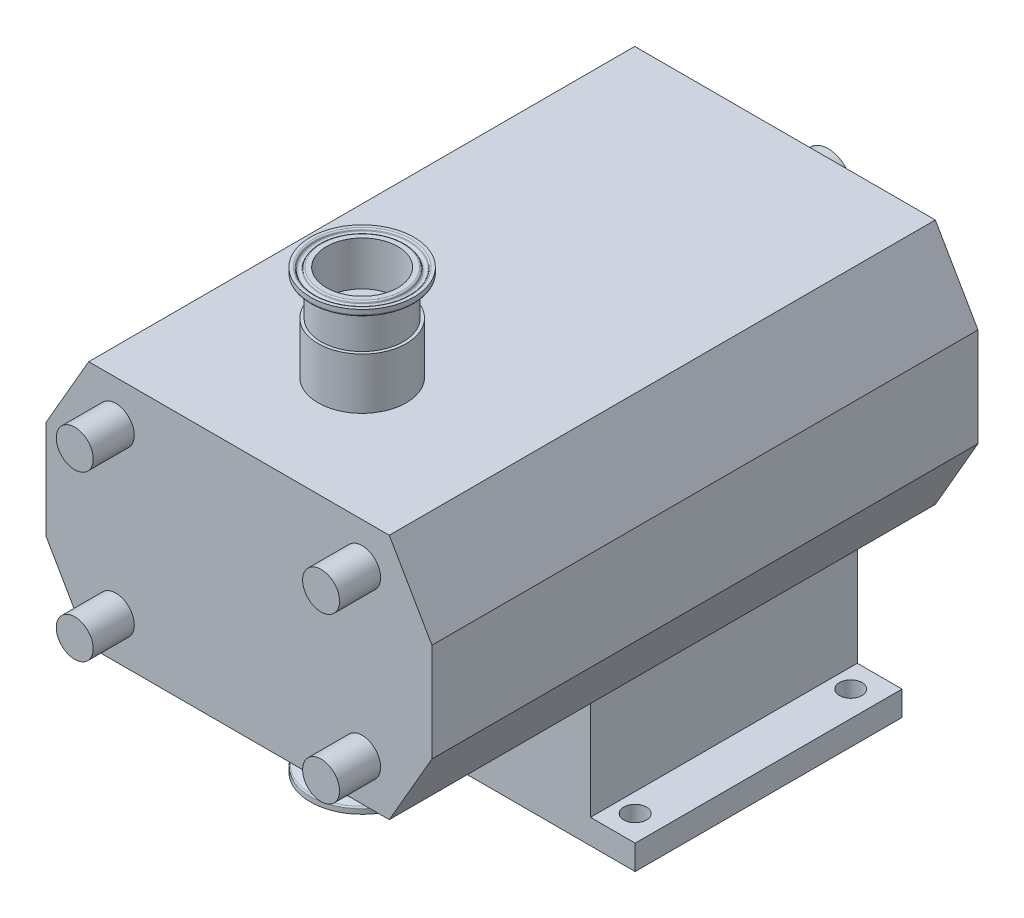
ISO-10303-21;
HEADER;
FILE_DESCRIPTION(('STEP AP214'),'2;1');
FILE_NAME('part.step','',(''),(''),'','','');
FILE_SCHEMA(('AUTOMOTIVE_DESIGN { 1 0 10303 214 1 1 1 1 }'));
ENDSEC;
DATA;
#1=APPLICATION_CONTEXT('core data for automotive mechanical design processes');
#2=APPLICATION_PROTOCOL_DEFINITION('international standard','automotive_design',2000,#1);
#3=PRODUCT_CONTEXT('',#1,'mechanical');
#4=PRODUCT('Part','Part','',(#3));
#5=PRODUCT_RELATED_PRODUCT_CATEGORY('part','',(#4));
#6=PRODUCT_DEFINITION_FORMATION('','',#4);
#7=PRODUCT_DEFINITION_CONTEXT('part definition',#1,'design');
#8=PRODUCT_DEFINITION('design','',#6,#7);
#9=PRODUCT_DEFINITION_SHAPE('','',#8);
#10=(LENGTH_UNIT() NAMED_UNIT(*) SI_UNIT(.MILLI.,.METRE.));
#11=(NAMED_UNIT(*) PLANE_ANGLE_UNIT() SI_UNIT($,.RADIAN.));
#12=(NAMED_UNIT(*) SI_UNIT($,.STERADIAN.) SOLID_ANGLE_UNIT());
#13=UNCERTAINTY_MEASURE_WITH_UNIT(LENGTH_MEASURE(1.E-05),#10,'distance_accuracy_value','');
#14=(GEOMETRIC_REPRESENTATION_CONTEXT(3) GLOBAL_UNCERTAINTY_ASSIGNED_CONTEXT((#13)) GLOBAL_UNIT_ASSIGNED_CONTEXT((#10,
#11,#12)) REPRESENTATION_CONTEXT('',''));
#15=CARTESIAN_POINT('',(0.,0.,0.));
#16=DIRECTION('',(0.,0.,1.));
#17=DIRECTION('',(1.,0.,0.));
#18=AXIS2_PLACEMENT_3D('',#15,#16,#17);
#19=CARTESIAN_POINT('',(-19.2960380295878,106.5,192.148478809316));
#20=DIRECTION('',(0.,1.,0.));
#21=DIRECTION('',(-0.583149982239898,0.,0.81236451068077));
#22=AXIS2_PLACEMENT_3D('',#19,#20,#21);
#23=PLANE('',#22);
#24=CARTESIAN_POINT('',(0.,106.5,206.));
#25=DIRECTION('',(0.,1.,0.));
#26=DIRECTION('',(-0.583149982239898,0.,0.81236451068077));
#27=AXIS2_PLACEMENT_3D('',#24,#25,#26);
#28=CIRCLE('',#27,25.25);
#29=CARTESIAN_POINT('',(-14.7245370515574,106.5,226.512203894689));
#30=VERTEX_POINT('',#29);
#31=EDGE_CURVE('P0_E10',#30,#30,#28,.T.);
#32=ORIENTED_EDGE('',*,*,#31,.T.);
#33=EDGE_LOOP('',(#32));
#34=FACE_BOUND('',#33,.T.);
#35=CARTESIAN_POINT('',(0.,106.5,206.));
#36=DIRECTION('',(0.,1.,0.));
#37=DIRECTION('',(-0.583149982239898,0.,0.81236451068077));
#38=AXIS2_PLACEMENT_3D('',#35,#36,#37);
#39=CIRCLE('',#38,23.7529308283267);
#40=CARTESIAN_POINT('',(-13.8515211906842,106.5,225.296038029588));
#41=VERTEX_POINT('',#40);
#42=EDGE_CURVE('P0_E61',#41,#41,#39,.T.);
#43=ORIENTED_EDGE('',*,*,#42,.F.);
#44=EDGE_LOOP('',(#43));
#45=FACE_BOUND('',#44,.T.);
#46=ADVANCED_FACE('P0_F15',(#34,#45),#23,.T.);
#47=CARTESIAN_POINT('',(0.,113.5,206.));
#48=DIRECTION('',(0.,1.,0.));
#49=DIRECTION('',(-0.583149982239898,0.,0.81236451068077));
#50=AXIS2_PLACEMENT_3D('',#47,#48,#49);
#51=CYLINDRICAL_SURFACE('',#50,25.25);
#52=CARTESIAN_POINT('',(0.,104.210166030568,206.));
#53=DIRECTION('',(0.,1.,0.));
#54=DIRECTION('',(-0.583149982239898,0.,0.81236451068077));
#55=AXIS2_PLACEMENT_3D('',#52,#53,#54);
#56=CIRCLE('',#55,25.25);
#57=CARTESIAN_POINT('',(-14.7245370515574,104.210166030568,226.512203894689));
#58=VERTEX_POINT('',#57);
#59=EDGE_CURVE('P0_E21',#58,#58,#56,.T.);
#60=ORIENTED_EDGE('',*,*,#59,.T.);
#61=EDGE_LOOP('',(#60));
#62=FACE_BOUND('',#61,.T.);
#63=ORIENTED_EDGE('',*,*,#31,.F.);
#64=EDGE_LOOP('',(#63));
#65=FACE_BOUND('',#64,.T.);
#66=ADVANCED_FACE('P0_F69',(#62,#65),#51,.T.);
#67=CARTESIAN_POINT('',(0.,104.210166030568,206.));
#68=DIRECTION('',(0.,1.,0.));
#69=DIRECTION('',(-0.583149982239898,0.,0.81236451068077));
#70=AXIS2_PLACEMENT_3D('',#67,#68,#69);
#71=TOROIDAL_SURFACE('',#70,24.45,0.799999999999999);
#72=CARTESIAN_POINT('',(0.,103.458411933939,206.));
#73=DIRECTION('',(0.,1.,0.));
#74=DIRECTION('',(-0.583149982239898,0.,0.81236451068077));
#75=AXIS2_PLACEMENT_3D('',#72,#73,#74);
#76=CIRCLE('',#75,24.7236161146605);
#77=CARTESIAN_POINT('',(-14.4175762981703,103.458411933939,226.084588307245));
#78=VERTEX_POINT('',#77);
#79=EDGE_CURVE('P0_E25',#78,#78,#76,.T.);
#80=ORIENTED_EDGE('',*,*,#79,.T.);
#81=EDGE_LOOP('',(#80));
#82=FACE_BOUND('',#81,.T.);
#83=ORIENTED_EDGE('',*,*,#59,.F.);
#84=EDGE_LOOP('',(#83));
#85=FACE_BOUND('',#84,.T.);
#86=ADVANCED_FACE('P0_F74',(#82,#85),#71,.T.);
#87=CARTESIAN_POINT('',(0.,103.458411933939,206.));
#88=DIRECTION('',(0.,1.,0.));
#89=DIRECTION('',(-0.583149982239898,0.,0.81236451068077));
#90=AXIS2_PLACEMENT_3D('',#87,#88,#89);
#91=CONICAL_SURFACE('',#90,24.7236161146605,1.22173047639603);
#92=CARTESIAN_POINT('',(0.,102.218126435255,206.));
#93=DIRECTION('',(0.,1.,0.));
#94=DIRECTION('',(-0.583149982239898,0.,0.81236451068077));
#95=AXIS2_PLACEMENT_3D('',#92,#93,#94);
#96=CIRCLE('',#95,21.3159597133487);
#97=CARTESIAN_POINT('',(-12.4304015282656,102.218126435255,223.316329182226));
#98=VERTEX_POINT('',#97);
#99=EDGE_CURVE('P0_E29',#98,#98,#96,.T.);
#100=ORIENTED_EDGE('',*,*,#99,.T.);
#101=EDGE_LOOP('',(#100));
#102=FACE_BOUND('',#101,.T.);
#103=ORIENTED_EDGE('',*,*,#79,.F.);
#104=EDGE_LOOP('',(#103));
#105=FACE_BOUND('',#104,.T.);
#106=ADVANCED_FACE('P0_F78',(#102,#105),#91,.T.);
#107=CARTESIAN_POINT('',(0.,100.338741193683,206.));
#108=DIRECTION('',(0.,1.,0.));
#109=DIRECTION('',(-0.583149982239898,0.,0.81236451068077));
#110=AXIS2_PLACEMENT_3D('',#107,#108,#109);
#111=TOROIDAL_SURFACE('',#110,22.,2.);
#112=CARTESIAN_POINT('',(0.,100.338741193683,206.));
#113=DIRECTION('',(0.,1.,0.));
#114=DIRECTION('',(-0.583149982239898,0.,0.81236451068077));
#115=AXIS2_PLACEMENT_3D('',#112,#113,#114);
#116=CIRCLE('',#115,20.);
#117=CARTESIAN_POINT('',(-11.6629996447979,100.338741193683,222.247290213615));
#118=VERTEX_POINT('',#117);
#119=EDGE_CURVE('P0_E34',#118,#118,#116,.T.);
#120=ORIENTED_EDGE('',*,*,#119,.T.);
#121=EDGE_LOOP('',(#120));
#122=FACE_BOUND('',#121,.T.);
#123=ORIENTED_EDGE('',*,*,#99,.F.);
#124=EDGE_LOOP('',(#123));
#125=FACE_BOUND('',#124,.T.);
#126=ADVANCED_FACE('P0_F85',(#122,#125),#111,.F.);
#127=CARTESIAN_POINT('',(0.,113.5,206.));
#128=DIRECTION('',(0.,1.,0.));
#129=DIRECTION('',(-0.583149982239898,0.,0.81236451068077));
#130=AXIS2_PLACEMENT_3D('',#127,#128,#129);
#131=CYLINDRICAL_SURFACE('',#130,20.);
#132=CARTESIAN_POINT('',(0.,85.,206.));
#133=DIRECTION('',(0.,1.,0.));
#134=DIRECTION('',(-0.583149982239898,0.,0.81236451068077));
#135=AXIS2_PLACEMENT_3D('',#132,#133,#134);
#136=CIRCLE('',#135,20.);
#137=CARTESIAN_POINT('',(-11.6629996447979,85.,222.247290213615));
#138=VERTEX_POINT('',#137);
#139=EDGE_CURVE('P0_E37',#138,#138,#136,.T.);
#140=ORIENTED_EDGE('',*,*,#139,.T.);
#141=EDGE_LOOP('',(#140));
#142=FACE_BOUND('',#141,.T.);
#143=ORIENTED_EDGE('',*,*,#119,.F.);
#144=EDGE_LOOP('',(#143));
#145=FACE_BOUND('',#144,.T.);
#146=ADVANCED_FACE('P0_F89',(#142,#145),#131,.T.);
#147=CARTESIAN_POINT('',(-14.1351424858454,85.,195.853190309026));
#148=DIRECTION('',(0.,-1.,0.));
#149=DIRECTION('',(0.583149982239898,0.,-0.81236451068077));
#150=AXIS2_PLACEMENT_3D('',#147,#148,#149);
#151=PLANE('',#150);
#152=CARTESIAN_POINT('',(0.,85.,206.));
#153=DIRECTION('',(0.,1.,0.));
#154=DIRECTION('',(-0.583149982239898,0.,0.81236451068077));
#155=AXIS2_PLACEMENT_3D('',#152,#153,#154);
#156=CIRCLE('',#155,17.4);
#157=CARTESIAN_POINT('',(-10.1468096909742,85.,220.135142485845));
#158=VERTEX_POINT('',#157);
#159=EDGE_CURVE('P0_E40',#158,#158,#156,.T.);
#160=ORIENTED_EDGE('',*,*,#159,.T.);
#161=EDGE_LOOP('',(#160));
#162=FACE_BOUND('',#161,.T.);
#163=ORIENTED_EDGE('',*,*,#139,.F.);
#164=EDGE_LOOP('',(#163));
#165=FACE_BOUND('',#164,.T.);
#166=ADVANCED_FACE('P0_F93',(#162,#165),#151,.T.);
#167=CARTESIAN_POINT('',(0.,113.5,206.));
#168=DIRECTION('',(0.,1.,0.));
#169=DIRECTION('',(-0.583149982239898,0.,0.81236451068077));
#170=AXIS2_PLACEMENT_3D('',#167,#168,#169);
#171=CYLINDRICAL_SURFACE('',#170,17.4);
#172=CARTESIAN_POINT('',(0.,106.5,206.));
#173=DIRECTION('',(0.,1.,0.));
#174=DIRECTION('',(-0.583149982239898,0.,0.81236451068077));
#175=AXIS2_PLACEMENT_3D('',#172,#173,#174);
#176=CIRCLE('',#175,17.4);
#177=CARTESIAN_POINT('',(-10.1468096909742,106.5,220.135142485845));
#178=VERTEX_POINT('',#177);
#179=EDGE_CURVE('P0_E43',#178,#178,#176,.T.);
#180=ORIENTED_EDGE('',*,*,#179,.T.);
#181=EDGE_LOOP('',(#180));
#182=FACE_BOUND('',#181,.T.);
#183=ORIENTED_EDGE('',*,*,#159,.F.);
#184=EDGE_LOOP('',(#183));
#185=FACE_BOUND('',#184,.T.);
#186=ADVANCED_FACE('P0_F97',(#182,#185),#171,.F.);
#187=CARTESIAN_POINT('',(-14.1351424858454,106.5,195.853190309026));
#188=DIRECTION('',(0.,1.,0.));
#189=DIRECTION('',(-0.583149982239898,0.,0.81236451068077));
#190=AXIS2_PLACEMENT_3D('',#187,#188,#189);
#191=PLANE('',#190);
#192=CARTESIAN_POINT('',(0.,106.5,206.));
#193=DIRECTION('',(0.,1.,0.));
#194=DIRECTION('',(-0.583149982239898,0.,0.81236451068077));
#195=AXIS2_PLACEMENT_3D('',#192,#193,#194);
#196=CIRCLE('',#195,19.7470691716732);
#197=CARTESIAN_POINT('',(-11.5155030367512,106.5,222.041818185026));
#198=VERTEX_POINT('',#197);
#199=EDGE_CURVE('P0_E46',#198,#198,#196,.T.);
#200=ORIENTED_EDGE('',*,*,#199,.T.);
#201=EDGE_LOOP('',(#200));
#202=FACE_BOUND('',#201,.T.);
#203=ORIENTED_EDGE('',*,*,#179,.F.);
#204=EDGE_LOOP('',(#203));
#205=FACE_BOUND('',#204,.T.);
#206=ADVANCED_FACE('P0_F101',(#202,#205),#191,.T.);
#207=CARTESIAN_POINT('',(0.,105.7,206.));
#208=DIRECTION('',(0.,1.,0.));
#209=DIRECTION('',(-0.583149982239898,0.,0.81236451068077));
#210=AXIS2_PLACEMENT_3D('',#207,#208,#209);
#211=TOROIDAL_SURFACE('',#210,19.7470691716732,0.800000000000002);
#212=CARTESIAN_POINT('',(0.,106.012584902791,206.));
#213=DIRECTION('',(0.,1.,0.));
#214=DIRECTION('',(-0.583149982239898,0.,0.81236451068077));
#215=AXIS2_PLACEMENT_3D('',#212,#213,#214);
#216=CIRCLE('',#215,20.4834730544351);
#217=CARTESIAN_POINT('',(-11.9449369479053,106.012584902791,222.640046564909));
#218=VERTEX_POINT('',#217);
#219=EDGE_CURVE('P0_E49',#218,#218,#216,.T.);
#220=ORIENTED_EDGE('',*,*,#219,.T.);
#221=EDGE_LOOP('',(#220));
#222=FACE_BOUND('',#221,.T.);
#223=ORIENTED_EDGE('',*,*,#199,.F.);
#224=EDGE_LOOP('',(#223));
#225=FACE_BOUND('',#224,.T.);
#226=ADVANCED_FACE('P0_F105',(#222,#225),#211,.T.);
#227=CARTESIAN_POINT('',(0.,106.012584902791,206.));
#228=DIRECTION('',(0.,-1.,0.));
#229=DIRECTION('',(0.583149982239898,0.,-0.81236451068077));
#230=AXIS2_PLACEMENT_3D('',#227,#228,#229);
#231=CONICAL_SURFACE('',#230,20.4834730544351,0.401425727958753);
#232=CARTESIAN_POINT('',(0.,105.631122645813,206.));
#233=DIRECTION('',(0.,1.,0.));
#234=DIRECTION('',(-0.583149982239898,0.,0.81236451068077));
#235=AXIS2_PLACEMENT_3D('',#232,#233,#234);
#236=CIRCLE('',#235,20.6453941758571);
#237=CARTESIAN_POINT('',(-12.0393612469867,105.631122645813,222.771585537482));
#238=VERTEX_POINT('',#237);
#239=EDGE_CURVE('P0_E52',#238,#238,#236,.T.);
#240=ORIENTED_EDGE('',*,*,#239,.T.);
#241=EDGE_LOOP('',(#240));
#242=FACE_BOUND('',#241,.T.);
#243=ORIENTED_EDGE('',*,*,#219,.F.);
#244=EDGE_LOOP('',(#243));
#245=FACE_BOUND('',#244,.T.);
#246=ADVANCED_FACE('P0_F109',(#242,#245),#231,.T.);
#247=CARTESIAN_POINT('',(0.,106.1,206.));
#248=DIRECTION('',(0.,1.,0.));
#249=DIRECTION('',(-0.583149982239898,0.,0.81236451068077));
#250=AXIS2_PLACEMENT_3D('',#247,#248,#249);
#251=TOROIDAL_SURFACE('',#250,21.75,1.2);
#252=CARTESIAN_POINT('',(0.,105.631122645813,206.));
#253=DIRECTION('',(0.,1.,0.));
#254=DIRECTION('',(-0.583149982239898,0.,0.81236451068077));
#255=AXIS2_PLACEMENT_3D('',#252,#253,#254);
#256=CIRCLE('',#255,22.854605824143);
#257=CARTESIAN_POINT('',(-13.3276629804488,105.631122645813,224.566270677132));
#258=VERTEX_POINT('',#257);
#259=EDGE_CURVE('P0_E55',#258,#258,#256,.T.);
#260=ORIENTED_EDGE('',*,*,#259,.T.);
#261=EDGE_LOOP('',(#260));
#262=FACE_BOUND('',#261,.T.);
#263=ORIENTED_EDGE('',*,*,#239,.F.);
#264=EDGE_LOOP('',(#263));
#265=FACE_BOUND('',#264,.T.);
#266=ADVANCED_FACE('P0_F113',(#262,#265),#251,.F.);
#267=CARTESIAN_POINT('',(0.,105.631122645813,206.));
#268=DIRECTION('',(0.,1.,0.));
#269=DIRECTION('',(-0.583149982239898,0.,0.81236451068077));
#270=AXIS2_PLACEMENT_3D('',#267,#268,#269);
#271=CONICAL_SURFACE('',#270,22.854605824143,0.401425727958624);
#272=CARTESIAN_POINT('',(0.,106.012584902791,206.));
#273=DIRECTION('',(0.,1.,0.));
#274=DIRECTION('',(-0.583149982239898,0.,0.81236451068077));
#275=AXIS2_PLACEMENT_3D('',#272,#273,#274);
#276=CIRCLE('',#275,23.0165269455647);
#277=CARTESIAN_POINT('',(-13.4220872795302,106.012584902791,224.697809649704));
#278=VERTEX_POINT('',#277);
#279=EDGE_CURVE('P0_E58',#278,#278,#276,.T.);
#280=ORIENTED_EDGE('',*,*,#279,.T.);
#281=EDGE_LOOP('',(#280));
#282=FACE_BOUND('',#281,.T.);
#283=ORIENTED_EDGE('',*,*,#259,.F.);
#284=EDGE_LOOP('',(#283));
#285=FACE_BOUND('',#284,.T.);
#286=ADVANCED_FACE('P0_F117',(#282,#285),#271,.F.);
#287=CARTESIAN_POINT('',(0.,105.7,206.));
#288=DIRECTION('',(0.,1.,0.));
#289=DIRECTION('',(-0.583149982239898,0.,0.81236451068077));
#290=AXIS2_PLACEMENT_3D('',#287,#288,#289);
#291=TOROIDAL_SURFACE('',#290,23.7529308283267,0.8);
#292=ORIENTED_EDGE('',*,*,#42,.T.);
#293=EDGE_LOOP('',(#292));
#294=FACE_BOUND('',#293,.T.);
#295=ORIENTED_EDGE('',*,*,#279,.F.);
#296=EDGE_LOOP('',(#295));
#297=FACE_BOUND('',#296,.T.);
#298=ADVANCED_FACE('P0_F65',(#294,#297),#291,.T.);
#299=CLOSED_SHELL('',(#46,#66,#86,#106,#126,#146,#166,#186,#206,#226,#246,#266,#286,#298));
#300=MANIFOLD_SOLID_BREP('P0_B1',#299);
#301=CARTESIAN_POINT('',(-31.,0.,241.732657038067));
#302=DIRECTION('',(0.,0.,1.));
#303=DIRECTION('',(1.,0.,0.));
#304=AXIS2_PLACEMENT_3D('',#301,#302,#303);
#305=CYLINDRICAL_SURFACE('',#304,12.);
#306=CARTESIAN_POINT('',(-31.,0.,-2.));
#307=DIRECTION('',(0.,0.,1.));
#308=DIRECTION('',(1.,0.,0.));
#309=AXIS2_PLACEMENT_3D('',#306,#307,#308);
#310=CIRCLE('',#309,12.);
#311=CARTESIAN_POINT('',(-19.,0.,-2.));
#312=VERTEX_POINT('',#311);
#313=EDGE_CURVE('P1_E277',#312,#312,#310,.T.);
#314=ORIENTED_EDGE('',*,*,#313,.F.);
#315=EDGE_LOOP('',(#314));
#316=FACE_BOUND('',#315,.T.);
#317=DIRECTION('',(0.,0.,1.));
#318=VECTOR('',#317,1.);
#319=CARTESIAN_POINT('',(-19.6862915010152,3.99999999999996,241.732657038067));
#320=LINE('',#319,#318);
#321=CARTESIAN_POINT('',(-19.6862915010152,4.,-52.));
#322=VERTEX_POINT('',#321);
#323=CARTESIAN_POINT('',(-19.6862915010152,4.,-22.));
#324=VERTEX_POINT('',#323);
#325=EDGE_CURVE('P1_E178',#322,#324,#320,.T.);
#326=ORIENTED_EDGE('',*,*,#325,.F.);
#327=CARTESIAN_POINT('',(-31.,0.,-52.));
#328=DIRECTION('',(0.,0.,1.));
#329=DIRECTION('',(1.,0.,0.));
#330=AXIS2_PLACEMENT_3D('',#327,#328,#329);
#331=CIRCLE('',#330,12.);
#332=CARTESIAN_POINT('',(-19.6862915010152,-4.,-52.));
#333=VERTEX_POINT('',#332);
#334=EDGE_CURVE('P1_E176',#322,#333,#331,.T.);
#335=ORIENTED_EDGE('',*,*,#334,.T.);
#336=DIRECTION('',(0.,0.,1.));
#337=VECTOR('',#336,1.);
#338=CARTESIAN_POINT('',(-19.6862915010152,-4.00000000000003,241.732657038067));
#339=LINE('',#338,#337);
#340=CARTESIAN_POINT('',(-19.6862915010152,-4.00000000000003,-22.));
#341=VERTEX_POINT('',#340);
#342=EDGE_CURVE('P1_E39',#341,#333,#339,.F.);
#343=ORIENTED_EDGE('',*,*,#342,.F.);
#344=CARTESIAN_POINT('',(-19.,0.,-26.));
#345=CARTESIAN_POINT('',(-18.9999993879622,0.218253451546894,-26.0000010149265));
#346=CARTESIAN_POINT('',(-19.0060092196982,0.436500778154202,-25.9820789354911));
#347=CARTESIAN_POINT('',(-19.0293915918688,0.866567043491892,-25.9110835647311));
#348=CARTESIAN_POINT('',(-19.0467653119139,1.07838531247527,-25.8580066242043));
#349=CARTESIAN_POINT('',(-19.0909876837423,1.4893311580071,-25.7187230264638));
#350=CARTESIAN_POINT('',(-19.1178204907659,1.68847930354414,-25.6325717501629));
#351=CARTESIAN_POINT('',(-19.1782221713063,2.0694997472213,-25.4298353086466));
#352=CARTESIAN_POINT('',(-19.2117923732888,2.25136862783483,-25.3132441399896));
#353=CARTESIAN_POINT('',(-19.2834362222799,2.59896670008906,-25.048696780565));
#354=CARTESIAN_POINT('',(-19.3216177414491,2.76401480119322,-24.899875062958));
#355=CARTESIAN_POINT('',(-19.3975874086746,3.06733077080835,-24.5769313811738));
#356=CARTESIAN_POINT('',(-19.4353754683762,3.20559274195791,-24.4028038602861));
#357=CARTESIAN_POINT('',(-19.5074667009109,3.45529976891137,-24.028059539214));
#358=CARTESIAN_POINT('',(-19.5416384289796,3.56585943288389,-23.826825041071));
#359=CARTESIAN_POINT('',(-19.6009877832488,3.75127549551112,-23.4072956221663));
#360=CARTESIAN_POINT('',(-19.6261681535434,3.82614278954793,-23.1890059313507));
#361=CARTESIAN_POINT('',(-19.6635478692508,3.93549384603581,-22.7493071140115));
#362=CARTESIAN_POINT('',(-19.6761561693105,3.97125379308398,-22.5282511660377));
#363=CARTESIAN_POINT('',(-19.6881737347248,4.005364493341,-22.0829449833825));
#364=CARTESIAN_POINT('',(-19.687587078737,4.00372680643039,-21.8586957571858));
#365=CARTESIAN_POINT('',(-19.6736394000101,3.96407961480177,-21.4242534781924));
#366=CARTESIAN_POINT('',(-19.6608633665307,3.92773565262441,-21.2138863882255));
#367=CARTESIAN_POINT('',(-19.6249336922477,3.82242465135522,-20.8024263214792));
#368=CARTESIAN_POINT('',(-19.6017788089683,3.75345370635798,-20.601334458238));
#369=CARTESIAN_POINT('',(-19.5472835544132,3.58375623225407,-20.2103490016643));
#370=CARTESIAN_POINT('',(-19.5158173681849,3.48253619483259,-20.02068789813));
#371=CARTESIAN_POINT('',(-19.4482976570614,3.251556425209,-19.660516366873));
#372=CARTESIAN_POINT('',(-19.4122428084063,3.12178844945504,-19.4900114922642));
#373=CARTESIAN_POINT('',(-19.3373068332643,2.82939733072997,-19.1636336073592));
#374=CARTESIAN_POINT('',(-19.2983764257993,2.66541260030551,-19.0089892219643));
#375=CARTESIAN_POINT('',(-19.2237224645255,2.31335827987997,-18.7290749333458));
#376=CARTESIAN_POINT('',(-19.1879992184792,2.12528638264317,-18.6038078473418));
#377=CARTESIAN_POINT('',(-19.1233156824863,1.72779045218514,-18.3852147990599));
#378=CARTESIAN_POINT('',(-19.0944259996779,1.51817310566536,-18.2922180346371));
#379=CARTESIAN_POINT('',(-19.0471773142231,1.085076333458,-18.1431873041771));
#380=CARTESIAN_POINT('',(-19.028814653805,0.8616017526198,-18.0871404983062));
#381=CARTESIAN_POINT('',(-19.0052949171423,0.417535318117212,-18.0157773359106));
#382=CARTESIAN_POINT('',(-18.9995999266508,0.197238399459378,-17.998800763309));
#383=CARTESIAN_POINT('',(-19.0004438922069,-0.243100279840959,-18.0013306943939));
#384=CARTESIAN_POINT('',(-19.0069807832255,-0.46314207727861,-18.0208310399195));
#385=CARTESIAN_POINT('',(-19.0311990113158,-0.89007946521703,-18.0944476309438));
#386=CARTESIAN_POINT('',(-19.0485520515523,-1.09717122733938,-18.147544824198));
#387=CARTESIAN_POINT('',(-19.0923261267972,-1.4994238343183,-18.2855737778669));
#388=CARTESIAN_POINT('',(-19.118748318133,-1.69458315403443,-18.3705095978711));
#389=CARTESIAN_POINT('',(-19.1788427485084,-2.0731531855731,-18.5722817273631));
#390=CARTESIAN_POINT('',(-19.2126874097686,-2.25611983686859,-18.6898983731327));
#391=CARTESIAN_POINT('',(-19.2837898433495,-2.60025932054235,-18.9527766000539));
#392=CARTESIAN_POINT('',(-19.3210486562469,-2.76142547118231,-19.0980466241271));
#393=CARTESIAN_POINT('',(-19.3969260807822,-3.0650100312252,-19.4199150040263));
#394=CARTESIAN_POINT('',(-19.4355295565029,-3.20624387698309,-19.5976369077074));
#395=CARTESIAN_POINT('',(-19.5080010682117,-3.4570300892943,-19.9750862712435));
#396=CARTESIAN_POINT('',(-19.5418690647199,-3.56658219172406,-20.1748139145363));
#397=CARTESIAN_POINT('',(-19.6007043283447,-3.75038772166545,-20.5906920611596));
#398=CARTESIAN_POINT('',(-19.6256895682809,-3.82471252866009,-20.8068083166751));
#399=CARTESIAN_POINT('',(-19.663566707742,-3.93557866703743,-21.2495146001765));
#400=CARTESIAN_POINT('',(-19.6764640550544,-3.97213701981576,-21.4760998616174));
#401=CARTESIAN_POINT('',(-19.6880856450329,-4.00510512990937,-21.9207883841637));
#402=CARTESIAN_POINT('',(-19.6875039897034,-4.0034810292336,-22.1387293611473));
#403=CARTESIAN_POINT('',(-19.6739492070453,-3.96496917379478,-22.5710602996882));
#404=CARTESIAN_POINT('',(-19.6609768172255,-3.92808351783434,-22.7854504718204));
#405=CARTESIAN_POINT('',(-19.6246190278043,-3.82148725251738,-23.2005426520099));
#406=CARTESIAN_POINT('',(-19.6014360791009,-3.75241338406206,-23.401427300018));
#407=CARTESIAN_POINT('',(-19.5473440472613,-3.58391746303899,-23.7889096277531));
#408=CARTESIAN_POINT('',(-19.5164332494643,-3.48448867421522,-23.975504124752));
#409=CARTESIAN_POINT('',(-19.4486868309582,-3.25304277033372,-24.3379346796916));
#410=CARTESIAN_POINT('',(-19.4116515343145,-3.11979297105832,-24.5129460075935));
#411=CARTESIAN_POINT('',(-19.3366657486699,-2.8265715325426,-24.8387592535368));
#412=CARTESIAN_POINT('',(-19.2987150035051,-2.66659233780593,-24.9895543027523));
#413=CARTESIAN_POINT('',(-19.2243987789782,-2.31696622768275,-25.2685776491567));
#414=CARTESIAN_POINT('',(-19.1881527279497,-2.12640605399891,-25.395697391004));
#415=CARTESIAN_POINT('',(-19.1229603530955,-1.7254294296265,-25.6159617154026));
#416=CARTESIAN_POINT('',(-19.0940121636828,-1.51501807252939,-25.7091149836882));
#417=CARTESIAN_POINT('',(-19.0477793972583,-1.0899745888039,-25.8548865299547));
#418=CARTESIAN_POINT('',(-19.0300315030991,-0.875951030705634,-25.9091298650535));
#419=CARTESIAN_POINT('',(-19.0061437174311,-0.441281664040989,-25.9816811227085));
#420=CARTESIAN_POINT('',(-19.0000006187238,-0.220637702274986,-25.9999989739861));
#421=CARTESIAN_POINT('',(-19.,0.,-26.));
#422=B_SPLINE_CURVE_WITH_KNOTS('',3,(#344,#345,#346,#347,#348,#349,#350,#351,#352,#353,#354,
#355,#356,#357,#358,#359,#360,#361,#362,#363,#364,#365,#366,#367,#368,#369,#370,#371,#372,#373,
#374,#375,#376,#377,#378,#379,#380,#381,#382,#383,#384,#385,#386,#387,#388,#389,#390,#391,#392,
#393,#394,#395,#396,#397,#398,#399,#400,#401,#402,#403,#404,#405,#406,#407,#408,#409,#410,#411,
#412,#413,#414,#415,#416,#417,#418,#419,#420,#421),.UNSPECIFIED.,.T.,.F.,(4,2,2,2,2,2,2,2,2,2,2,
2,2,2,2,2,2,2,2,2,2,2,2,2,2,2,2,2,2,2,2,2,2,2,2,2,2,2,4),(0.,0.653948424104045,1.30796474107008,
1.96089069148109,2.6139455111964,3.28738737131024,3.96097733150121,4.65393539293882,
5.34668178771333,6.01607702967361,6.68526535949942,7.32387306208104,7.96255723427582,
8.61152684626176,9.26068410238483,9.94373223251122,10.6268458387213,11.3167362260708,
12.0063867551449,12.6661433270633,13.3257885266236,13.9663263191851,14.6069458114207,
15.264415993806,15.9220872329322,16.6096409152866,17.2972003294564,17.9833605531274,
18.6692113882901,19.3198266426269,19.9704031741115,20.6086234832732,21.2469855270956,
21.9132026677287,22.5796084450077,23.2719864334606,23.9641872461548,24.6254623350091,
25.2865546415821),.UNSPECIFIED.);
#423=EDGE_CURVE('P1_E11',#324,#341,#422,.T.);
#424=ORIENTED_EDGE('',*,*,#423,.F.);
#425=EDGE_LOOP('',(#326,#335,#343,#424));
#426=FACE_BOUND('',#425,.T.);
#427=ADVANCED_FACE('P1_F17',(#316,#426),#305,.T.);
#428=CARTESIAN_POINT('',(-73.2153903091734,-60.,266.));
#429=DIRECTION('',(0.,1.,0.));
#430=DIRECTION('',(-1.,0.,0.));
#431=AXIS2_PLACEMENT_3D('',#428,#429,#430);
#432=PLANE('',#431);
#433=CARTESIAN_POINT('',(0.,-60.,206.));
#434=DIRECTION('',(0.,1.,0.));
#435=DIRECTION('',(-1.,0.,0.));
#436=AXIS2_PLACEMENT_3D('',#433,#434,#435);
#437=CIRCLE('',#436,21.5);
#438=CARTESIAN_POINT('',(-21.5,-60.,206.));
#439=VERTEX_POINT('',#438);
#440=EDGE_CURVE('P1_E192',#439,#439,#437,.T.);
#441=ORIENTED_EDGE('',*,*,#440,.T.);
#442=EDGE_LOOP('',(#441));
#443=FACE_BOUND('',#442,.T.);
#444=DIRECTION('',(1.,0.,0.));
#445=VECTOR('',#444,1.);
#446=CARTESIAN_POINT('',(-73.2153903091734,-60.,0.));
#447=LINE('',#446,#445);
#448=CARTESIAN_POINT('',(-73.2153903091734,-60.,0.));
#449=VERTEX_POINT('',#448);
#450=CARTESIAN_POINT('',(73.2153903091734,-60.,0.));
#451=VERTEX_POINT('',#450);
#452=EDGE_CURVE('P1_E337',#449,#451,#447,.T.);
#453=ORIENTED_EDGE('',*,*,#452,.T.);
#454=DIRECTION('',(0.,0.,-1.));
#455=VECTOR('',#454,1.);
#456=CARTESIAN_POINT('',(73.2153903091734,-60.,266.));
#457=LINE('',#456,#455);
#458=CARTESIAN_POINT('',(73.2153903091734,-60.,266.));
#459=VERTEX_POINT('',#458);
#460=EDGE_CURVE('P1_E347',#459,#451,#457,.T.);
#461=ORIENTED_EDGE('',*,*,#460,.F.);
#462=DIRECTION('',(1.,0.,0.));
#463=VECTOR('',#462,1.);
#464=CARTESIAN_POINT('',(-73.2153903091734,-60.,266.));
#465=LINE('',#464,#463);
#466=CARTESIAN_POINT('',(-73.2153903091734,-60.,266.));
#467=VERTEX_POINT('',#466);
#468=EDGE_CURVE('P1_E320',#467,#459,#465,.T.);
#469=ORIENTED_EDGE('',*,*,#468,.F.);
#470=DIRECTION('',(0.,0.,-1.));
#471=VECTOR('',#470,1.);
#472=CARTESIAN_POINT('',(-73.2153903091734,-60.,266.));
#473=LINE('',#472,#471);
#474=EDGE_CURVE('P1_E350',#467,#449,#473,.T.);
#475=ORIENTED_EDGE('',*,*,#474,.T.);
#476=EDGE_LOOP('',(#453,#461,#469,#475));
#477=FACE_BOUND('',#476,.T.);
#478=DIRECTION('',(1.,0.,0.));
#479=VECTOR('',#478,1.);
#480=CARTESIAN_POINT('',(53.2153903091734,-60.,18.));
#481=LINE('',#480,#479);
#482=CARTESIAN_POINT('',(-53.2153903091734,-60.,18.));
#483=VERTEX_POINT('',#482);
#484=CARTESIAN_POINT('',(53.2153903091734,-60.,18.));
#485=VERTEX_POINT('',#484);
#486=EDGE_CURVE('P1_E220',#483,#485,#481,.T.);
#487=ORIENTED_EDGE('',*,*,#486,.F.);
#488=DIRECTION('',(0.,0.,1.));
#489=VECTOR('',#488,1.);
#490=CARTESIAN_POINT('',(-53.2153903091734,-60.,18.));
#491=LINE('',#490,#489);
#492=CARTESIAN_POINT('',(-53.2153903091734,-60.,148.));
#493=VERTEX_POINT('',#492);
#494=EDGE_CURVE('P1_E238',#483,#493,#491,.T.);
#495=ORIENTED_EDGE('',*,*,#494,.T.);
#496=DIRECTION('',(1.,0.,0.));
#497=VECTOR('',#496,1.);
#498=CARTESIAN_POINT('',(53.2153903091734,-60.,148.));
#499=LINE('',#498,#497);
#500=CARTESIAN_POINT('',(53.2153903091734,-60.,148.));
#501=VERTEX_POINT('',#500);
#502=EDGE_CURVE('P1_E219',#493,#501,#499,.T.);
#503=ORIENTED_EDGE('',*,*,#502,.T.);
#504=DIRECTION('',(0.,0.,1.));
#505=VECTOR('',#504,1.);
#506=CARTESIAN_POINT('',(53.2153903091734,-60.,18.));
#507=LINE('',#506,#505);
#508=EDGE_CURVE('P1_E274',#485,#501,#507,.T.);
#509=ORIENTED_EDGE('',*,*,#508,.F.);
#510=EDGE_LOOP('',(#487,#495,#503,#509));
#511=FACE_BOUND('',#510,.T.);
#512=ADVANCED_FACE('P1_F393',(#443,#477,#511),#432,.F.);
#513=CARTESIAN_POINT('',(107.856406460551,0.,0.));
#514=DIRECTION('',(0.,0.,1.));
#515=DIRECTION('',(1.,0.,0.));
#516=AXIS2_PLACEMENT_3D('',#513,#514,#515);
#517=PLANE('',#516);
#518=DIRECTION('',(-0.500000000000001,0.866025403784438,0.));
#519=VECTOR('',#518,1.);
#520=CARTESIAN_POINT('',(73.2153903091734,60.,0.));
#521=LINE('',#520,#519);
#522=CARTESIAN_POINT('',(94.,24.,0.));
#523=VERTEX_POINT('',#522);
#524=CARTESIAN_POINT('',(73.2153903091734,60.,0.));
#525=VERTEX_POINT('',#524);
#526=EDGE_CURVE('P1_E305',#523,#525,#521,.T.);
#527=ORIENTED_EDGE('',*,*,#526,.F.);
#528=DIRECTION('',(0.,1.,0.));
#529=VECTOR('',#528,1.);
#530=CARTESIAN_POINT('',(94.,24.,0.));
#531=LINE('',#530,#529);
#532=CARTESIAN_POINT('',(94.,-24.,0.));
#533=VERTEX_POINT('',#532);
#534=EDGE_CURVE('P1_E312',#533,#523,#531,.T.);
#535=ORIENTED_EDGE('',*,*,#534,.F.);
#536=DIRECTION('',(0.500000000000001,0.866025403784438,0.));
#537=VECTOR('',#536,1.);
#538=CARTESIAN_POINT('',(73.2153903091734,-60.,0.));
#539=LINE('',#538,#537);
#540=EDGE_CURVE('P1_E339',#451,#533,#539,.T.);
#541=ORIENTED_EDGE('',*,*,#540,.F.);
#542=ORIENTED_EDGE('',*,*,#452,.F.);
#543=DIRECTION('',(0.500000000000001,-0.866025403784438,0.));
#544=VECTOR('',#543,1.);
#545=CARTESIAN_POINT('',(-73.2153903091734,-60.,0.));
#546=LINE('',#545,#544);
#547=CARTESIAN_POINT('',(-94.,-24.,0.));
#548=VERTEX_POINT('',#547);
#549=EDGE_CURVE('P1_E335',#548,#449,#546,.T.);
#550=ORIENTED_EDGE('',*,*,#549,.F.);
#551=DIRECTION('',(0.,-1.,0.));
#552=VECTOR('',#551,1.);
#553=CARTESIAN_POINT('',(-94.,24.,0.));
#554=LINE('',#553,#552);
#555=CARTESIAN_POINT('',(-94.,24.,0.));
#556=VERTEX_POINT('',#555);
#557=EDGE_CURVE('P1_E333',#556,#548,#554,.T.);
#558=ORIENTED_EDGE('',*,*,#557,.F.);
#559=DIRECTION('',(-0.500000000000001,-0.866025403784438,0.));
#560=VECTOR('',#559,1.);
#561=CARTESIAN_POINT('',(-73.2153903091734,60.,0.));
#562=LINE('',#561,#560);
#563=CARTESIAN_POINT('',(-73.2153903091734,60.,0.));
#564=VERTEX_POINT('',#563);
#565=EDGE_CURVE('P1_E331',#564,#556,#562,.T.);
#566=ORIENTED_EDGE('',*,*,#565,.F.);
#567=DIRECTION('',(-1.,0.,0.));
#568=VECTOR('',#567,1.);
#569=CARTESIAN_POINT('',(-73.2153903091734,60.,0.));
#570=LINE('',#569,#568);
#571=EDGE_CURVE('P1_E329',#525,#564,#570,.T.);
#572=ORIENTED_EDGE('',*,*,#571,.F.);
#573=EDGE_LOOP('',(#527,#535,#541,#542,#550,#558,#566,#572));
#574=FACE_BOUND('',#573,.T.);
#575=CARTESIAN_POINT('',(-31.,0.,0.));
#576=DIRECTION('',(0.,0.,1.));
#577=DIRECTION('',(1.,0.,0.));
#578=AXIS2_PLACEMENT_3D('',#575,#576,#577);
#579=CIRCLE('',#578,15.);
#580=CARTESIAN_POINT('',(-16.,0.,0.));
#581=VERTEX_POINT('',#580);
#582=EDGE_CURVE('P1_E29',#581,#581,#579,.F.);
#583=ORIENTED_EDGE('',*,*,#582,.F.);
#584=EDGE_LOOP('',(#583));
#585=FACE_BOUND('',#584,.T.);
#586=ADVANCED_FACE('P1_F399',(#574,#585),#517,.F.);
#587=CARTESIAN_POINT('',(107.856406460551,0.,266.));
#588=DIRECTION('',(0.,0.,1.));
#589=DIRECTION('',(1.,0.,0.));
#590=AXIS2_PLACEMENT_3D('',#587,#588,#589);
#591=PLANE('',#590);
#592=CARTESIAN_POINT('',(60.,-40.,266.));
#593=DIRECTION('',(0.,0.,1.));
#594=DIRECTION('',(1.,0.,0.));
#595=AXIS2_PLACEMENT_3D('',#592,#593,#594);
#596=CIRCLE('',#595,9.);
#597=CARTESIAN_POINT('',(69.,-40.,266.));
#598=VERTEX_POINT('',#597);
#599=EDGE_CURVE('P1_E287',#598,#598,#596,.T.);
#600=ORIENTED_EDGE('',*,*,#599,.F.);
#601=EDGE_LOOP('',(#600));
#602=FACE_BOUND('',#601,.T.);
#603=CARTESIAN_POINT('',(-60.,40.,266.));
#604=DIRECTION('',(0.,0.,1.));
#605=DIRECTION('',(1.,0.,0.));
#606=AXIS2_PLACEMENT_3D('',#603,#604,#605);
#607=CIRCLE('',#606,9.);
#608=CARTESIAN_POINT('',(-51.,40.,266.));
#609=VERTEX_POINT('',#608);
#610=EDGE_CURVE('P1_E299',#609,#609,#607,.T.);
#611=ORIENTED_EDGE('',*,*,#610,.F.);
#612=EDGE_LOOP('',(#611));
#613=FACE_BOUND('',#612,.T.);
#614=DIRECTION('',(-0.500000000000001,0.866025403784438,0.));
#615=VECTOR('',#614,1.);
#616=CARTESIAN_POINT('',(73.2153903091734,60.,266.));
#617=LINE('',#616,#615);
#618=CARTESIAN_POINT('',(94.,24.,266.));
#619=VERTEX_POINT('',#618);
#620=CARTESIAN_POINT('',(73.2153903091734,60.,266.));
#621=VERTEX_POINT('',#620);
#622=EDGE_CURVE('P1_E308',#619,#621,#617,.T.);
#623=ORIENTED_EDGE('',*,*,#622,.T.);
#624=DIRECTION('',(-1.,0.,0.));
#625=VECTOR('',#624,1.);
#626=CARTESIAN_POINT('',(-73.2153903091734,60.,266.));
#627=LINE('',#626,#625);
#628=CARTESIAN_POINT('',(-73.2153903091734,60.,266.));
#629=VERTEX_POINT('',#628);
#630=EDGE_CURVE('P1_E311',#621,#629,#627,.T.);
#631=ORIENTED_EDGE('',*,*,#630,.T.);
#632=DIRECTION('',(-0.500000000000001,-0.866025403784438,0.));
#633=VECTOR('',#632,1.);
#634=CARTESIAN_POINT('',(-73.2153903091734,60.,266.));
#635=LINE('',#634,#633);
#636=CARTESIAN_POINT('',(-94.,24.,266.));
#637=VERTEX_POINT('',#636);
#638=EDGE_CURVE('P1_E314',#629,#637,#635,.T.);
#639=ORIENTED_EDGE('',*,*,#638,.T.);
#640=DIRECTION('',(0.,-1.,0.));
#641=VECTOR('',#640,1.);
#642=CARTESIAN_POINT('',(-94.,24.,266.));
#643=LINE('',#642,#641);
#644=CARTESIAN_POINT('',(-94.,-24.,266.));
#645=VERTEX_POINT('',#644);
#646=EDGE_CURVE('P1_E316',#637,#645,#643,.T.);
#647=ORIENTED_EDGE('',*,*,#646,.T.);
#648=DIRECTION('',(0.500000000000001,-0.866025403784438,0.));
#649=VECTOR('',#648,1.);
#650=CARTESIAN_POINT('',(-73.2153903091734,-60.,266.));
#651=LINE('',#650,#649);
#652=EDGE_CURVE('P1_E318',#645,#467,#651,.T.);
#653=ORIENTED_EDGE('',*,*,#652,.T.);
#654=ORIENTED_EDGE('',*,*,#468,.T.);
#655=DIRECTION('',(0.500000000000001,0.866025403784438,0.));
#656=VECTOR('',#655,1.);
#657=CARTESIAN_POINT('',(73.2153903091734,-60.,266.));
#658=LINE('',#657,#656);
#659=CARTESIAN_POINT('',(94.,-24.,266.));
#660=VERTEX_POINT('',#659);
#661=EDGE_CURVE('P1_E322',#459,#660,#658,.T.);
#662=ORIENTED_EDGE('',*,*,#661,.T.);
#663=DIRECTION('',(0.,1.,0.));
#664=VECTOR('',#663,1.);
#665=CARTESIAN_POINT('',(94.,24.,266.));
#666=LINE('',#665,#664);
#667=EDGE_CURVE('P1_E324',#660,#619,#666,.T.);
#668=ORIENTED_EDGE('',*,*,#667,.T.);
#669=EDGE_LOOP('',(#623,#631,#639,#647,#653,#654,#662,#668));
#670=FACE_BOUND('',#669,.T.);
#671=CARTESIAN_POINT('',(60.,40.,266.));
#672=DIRECTION('',(0.,0.,1.));
#673=DIRECTION('',(1.,0.,0.));
#674=AXIS2_PLACEMENT_3D('',#671,#672,#673);
#675=CIRCLE('',#674,9.);
#676=CARTESIAN_POINT('',(69.,40.,266.));
#677=VERTEX_POINT('',#676);
#678=EDGE_CURVE('P1_E293',#677,#677,#675,.T.);
#679=ORIENTED_EDGE('',*,*,#678,.F.);
#680=EDGE_LOOP('',(#679));
#681=FACE_BOUND('',#680,.T.);
#682=CARTESIAN_POINT('',(-60.,-40.,266.));
#683=DIRECTION('',(0.,0.,1.));
#684=DIRECTION('',(1.,0.,0.));
#685=AXIS2_PLACEMENT_3D('',#682,#683,#684);
#686=CIRCLE('',#685,9.);
#687=CARTESIAN_POINT('',(-51.,-40.,266.));
#688=VERTEX_POINT('',#687);
#689=EDGE_CURVE('P1_E283',#688,#688,#686,.T.);
#690=ORIENTED_EDGE('',*,*,#689,.F.);
#691=EDGE_LOOP('',(#690));
#692=FACE_BOUND('',#691,.T.);
#693=ADVANCED_FACE('P1_F448',(#602,#613,#670,#681,#692),#591,.T.);
#694=CARTESIAN_POINT('',(73.2153903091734,60.,266.));
#695=DIRECTION('',(-0.866025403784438,-0.500000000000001,0.));
#696=DIRECTION('',(0.500000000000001,-0.866025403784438,0.));
#697=AXIS2_PLACEMENT_3D('',#694,#695,#696);
#698=PLANE('',#697);
#699=ORIENTED_EDGE('',*,*,#526,.T.);
#700=DIRECTION('',(0.,0.,-1.));
#701=VECTOR('',#700,1.);
#702=CARTESIAN_POINT('',(73.2153903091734,60.,266.));
#703=LINE('',#702,#701);
#704=EDGE_CURVE('P1_E362',#621,#525,#703,.T.);
#705=ORIENTED_EDGE('',*,*,#704,.F.);
#706=ORIENTED_EDGE('',*,*,#622,.F.);
#707=DIRECTION('',(0.,0.,-1.));
#708=VECTOR('',#707,1.);
#709=CARTESIAN_POINT('',(94.,24.,266.));
#710=LINE('',#709,#708);
#711=EDGE_CURVE('P1_E326',#619,#523,#710,.T.);
#712=ORIENTED_EDGE('',*,*,#711,.T.);
#713=EDGE_LOOP('',(#699,#705,#706,#712));
#714=FACE_BOUND('',#713,.T.);
#715=ADVANCED_FACE('P1_F19',(#714),#698,.F.);
#716=CARTESIAN_POINT('',(-73.2153903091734,60.,266.));
#717=DIRECTION('',(0.,-1.,0.));
#718=DIRECTION('',(1.,0.,0.));
#719=AXIS2_PLACEMENT_3D('',#716,#717,#718);
#720=PLANE('',#719);
#721=CARTESIAN_POINT('',(0.,60.,206.));
#722=DIRECTION('',(0.,-1.,0.));
#723=DIRECTION('',(1.,0.,0.));
#724=AXIS2_PLACEMENT_3D('',#721,#722,#723);
#725=CIRCLE('',#724,21.5);
#726=CARTESIAN_POINT('',(21.5,60.,206.));
#727=VERTEX_POINT('',#726);
#728=EDGE_CURVE('P1_E191',#727,#727,#725,.T.);
#729=ORIENTED_EDGE('',*,*,#728,.T.);
#730=EDGE_LOOP('',(#729));
#731=FACE_BOUND('',#730,.T.);
#732=ORIENTED_EDGE('',*,*,#571,.T.);
#733=DIRECTION('',(0.,0.,-1.));
#734=VECTOR('',#733,1.);
#735=CARTESIAN_POINT('',(-73.2153903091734,60.,266.));
#736=LINE('',#735,#734);
#737=EDGE_CURVE('P1_E359',#629,#564,#736,.T.);
#738=ORIENTED_EDGE('',*,*,#737,.F.);
#739=ORIENTED_EDGE('',*,*,#630,.F.);
#740=ORIENTED_EDGE('',*,*,#704,.T.);
#741=EDGE_LOOP('',(#732,#738,#739,#740));
#742=FACE_BOUND('',#741,.T.);
#743=ADVANCED_FACE('P1_F369',(#731,#742),#720,.F.);
#744=CARTESIAN_POINT('',(-73.2153903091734,60.,266.));
#745=DIRECTION('',(0.866025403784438,-0.500000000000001,0.));
#746=DIRECTION('',(0.500000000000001,0.866025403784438,0.));
#747=AXIS2_PLACEMENT_3D('',#744,#745,#746);
#748=PLANE('',#747);
#749=ORIENTED_EDGE('',*,*,#565,.T.);
#750=DIRECTION('',(0.,0.,-1.));
#751=VECTOR('',#750,1.);
#752=CARTESIAN_POINT('',(-94.,24.,266.));
#753=LINE('',#752,#751);
#754=EDGE_CURVE('P1_E356',#637,#556,#753,.T.);
#755=ORIENTED_EDGE('',*,*,#754,.F.);
#756=ORIENTED_EDGE('',*,*,#638,.F.);
#757=ORIENTED_EDGE('',*,*,#737,.T.);
#758=EDGE_LOOP('',(#749,#755,#756,#757));
#759=FACE_BOUND('',#758,.T.);
#760=ADVANCED_FACE('P1_F469',(#759),#748,.F.);
#761=CARTESIAN_POINT('',(-94.,24.,266.));
#762=DIRECTION('',(1.,0.,0.));
#763=DIRECTION('',(0.,0.,-1.));
#764=AXIS2_PLACEMENT_3D('',#761,#762,#763);
#765=PLANE('',#764);
#766=ORIENTED_EDGE('',*,*,#557,.T.);
#767=DIRECTION('',(0.,0.,-1.));
#768=VECTOR('',#767,1.);
#769=CARTESIAN_POINT('',(-94.,-24.,266.));
#770=LINE('',#769,#768);
#771=EDGE_CURVE('P1_E353',#645,#548,#770,.T.);
#772=ORIENTED_EDGE('',*,*,#771,.F.);
#773=ORIENTED_EDGE('',*,*,#646,.F.);
#774=ORIENTED_EDGE('',*,*,#754,.T.);
#775=EDGE_LOOP('',(#766,#772,#773,#774));
#776=FACE_BOUND('',#775,.T.);
#777=ADVANCED_FACE('P1_F465',(#776),#765,.F.);
#778=CARTESIAN_POINT('',(-73.2153903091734,-60.,266.));
#779=DIRECTION('',(0.866025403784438,0.500000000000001,0.));
#780=DIRECTION('',(-0.500000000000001,0.866025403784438,0.));
#781=AXIS2_PLACEMENT_3D('',#778,#779,#780);
#782=PLANE('',#781);
#783=ORIENTED_EDGE('',*,*,#549,.T.);
#784=ORIENTED_EDGE('',*,*,#474,.F.);
#785=ORIENTED_EDGE('',*,*,#652,.F.);
#786=ORIENTED_EDGE('',*,*,#771,.T.);
#787=EDGE_LOOP('',(#783,#784,#785,#786));
#788=FACE_BOUND('',#787,.T.);
#789=ADVANCED_FACE('P1_F460',(#788),#782,.F.);
#790=CARTESIAN_POINT('',(73.2153903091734,-60.,266.));
#791=DIRECTION('',(-0.866025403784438,0.500000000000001,0.));
#792=DIRECTION('',(-0.500000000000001,-0.866025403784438,0.));
#793=AXIS2_PLACEMENT_3D('',#790,#791,#792);
#794=PLANE('',#793);
#795=ORIENTED_EDGE('',*,*,#540,.T.);
#796=DIRECTION('',(0.,0.,-1.));
#797=VECTOR('',#796,1.);
#798=CARTESIAN_POINT('',(94.,-24.,266.));
#799=LINE('',#798,#797);
#800=EDGE_CURVE('P1_E344',#660,#533,#799,.T.);
#801=ORIENTED_EDGE('',*,*,#800,.F.);
#802=ORIENTED_EDGE('',*,*,#661,.F.);
#803=ORIENTED_EDGE('',*,*,#460,.T.);
#804=EDGE_LOOP('',(#795,#801,#802,#803));
#805=FACE_BOUND('',#804,.T.);
#806=ADVANCED_FACE('P1_F457',(#805),#794,.F.);
#807=CARTESIAN_POINT('',(94.,24.,266.));
#808=DIRECTION('',(-1.,0.,0.));
#809=DIRECTION('',(0.,0.,1.));
#810=AXIS2_PLACEMENT_3D('',#807,#808,#809);
#811=PLANE('',#810);
#812=ORIENTED_EDGE('',*,*,#534,.T.);
#813=ORIENTED_EDGE('',*,*,#711,.F.);
#814=ORIENTED_EDGE('',*,*,#667,.F.);
#815=ORIENTED_EDGE('',*,*,#800,.T.);
#816=EDGE_LOOP('',(#812,#813,#814,#815));
#817=FACE_BOUND('',#816,.T.);
#818=ADVANCED_FACE('P1_F446',(#817),#811,.F.);
#819=CARTESIAN_POINT('',(-60.,40.,286.));
#820=DIRECTION('',(0.,0.,-1.));
#821=DIRECTION('',(-1.,0.,0.));
#822=AXIS2_PLACEMENT_3D('',#819,#820,#821);
#823=CYLINDRICAL_SURFACE('',#822,9.);
#824=CARTESIAN_POINT('',(-60.,40.,286.));
#825=DIRECTION('',(0.,0.,1.));
#826=DIRECTION('',(1.,0.,0.));
#827=AXIS2_PLACEMENT_3D('',#824,#825,#826);
#828=CIRCLE('',#827,9.);
#829=CARTESIAN_POINT('',(-51.,40.,286.));
#830=VERTEX_POINT('',#829);
#831=EDGE_CURVE('P1_E302',#830,#830,#828,.T.);
#832=ORIENTED_EDGE('',*,*,#831,.F.);
#833=EDGE_LOOP('',(#832));
#834=FACE_BOUND('',#833,.T.);
#835=ORIENTED_EDGE('',*,*,#610,.T.);
#836=EDGE_LOOP('',(#835));
#837=FACE_BOUND('',#836,.T.);
#838=ADVANCED_FACE('P1_F442',(#834,#837),#823,.T.);
#839=CARTESIAN_POINT('',(-60.,40.,286.));
#840=DIRECTION('',(0.,0.,1.));
#841=DIRECTION('',(1.,0.,0.));
#842=AXIS2_PLACEMENT_3D('',#839,#840,#841);
#843=PLANE('',#842);
#844=ORIENTED_EDGE('',*,*,#831,.T.);
#845=EDGE_LOOP('',(#844));
#846=FACE_BOUND('',#845,.T.);
#847=ADVANCED_FACE('P1_F438',(#846),#843,.T.);
#848=CARTESIAN_POINT('',(60.,40.,286.));
#849=DIRECTION('',(0.,0.,-1.));
#850=DIRECTION('',(-1.,0.,0.));
#851=AXIS2_PLACEMENT_3D('',#848,#849,#850);
#852=CYLINDRICAL_SURFACE('',#851,9.);
#853=CARTESIAN_POINT('',(60.,40.,286.));
#854=DIRECTION('',(0.,0.,1.));
#855=DIRECTION('',(1.,0.,0.));
#856=AXIS2_PLACEMENT_3D('',#853,#854,#855);
#857=CIRCLE('',#856,9.);
#858=CARTESIAN_POINT('',(69.,40.,286.));
#859=VERTEX_POINT('',#858);
#860=EDGE_CURVE('P1_E296',#859,#859,#857,.T.);
#861=ORIENTED_EDGE('',*,*,#860,.F.);
#862=EDGE_LOOP('',(#861));
#863=FACE_BOUND('',#862,.T.);
#864=ORIENTED_EDGE('',*,*,#678,.T.);
#865=EDGE_LOOP('',(#864));
#866=FACE_BOUND('',#865,.T.);
#867=ADVANCED_FACE('P1_F434',(#863,#866),#852,.T.);
#868=CARTESIAN_POINT('',(60.,40.,286.));
#869=DIRECTION('',(0.,0.,1.));
#870=DIRECTION('',(1.,0.,0.));
#871=AXIS2_PLACEMENT_3D('',#868,#869,#870);
#872=PLANE('',#871);
#873=ORIENTED_EDGE('',*,*,#860,.T.);
#874=EDGE_LOOP('',(#873));
#875=FACE_BOUND('',#874,.T.);
#876=ADVANCED_FACE('P1_F430',(#875),#872,.T.);
#877=CARTESIAN_POINT('',(60.,-40.,286.));
#878=DIRECTION('',(0.,0.,-1.));
#879=DIRECTION('',(-1.,0.,0.));
#880=AXIS2_PLACEMENT_3D('',#877,#878,#879);
#881=CYLINDRICAL_SURFACE('',#880,9.);
#882=CARTESIAN_POINT('',(60.,-40.,286.));
#883=DIRECTION('',(0.,0.,1.));
#884=DIRECTION('',(1.,0.,0.));
#885=AXIS2_PLACEMENT_3D('',#882,#883,#884);
#886=CIRCLE('',#885,9.);
#887=CARTESIAN_POINT('',(69.,-40.,286.));
#888=VERTEX_POINT('',#887);
#889=EDGE_CURVE('P1_E290',#888,#888,#886,.T.);
#890=ORIENTED_EDGE('',*,*,#889,.F.);
#891=EDGE_LOOP('',(#890));
#892=FACE_BOUND('',#891,.T.);
#893=ORIENTED_EDGE('',*,*,#599,.T.);
#894=EDGE_LOOP('',(#893));
#895=FACE_BOUND('',#894,.T.);
#896=ADVANCED_FACE('P1_F426',(#892,#895),#881,.T.);
#897=CARTESIAN_POINT('',(60.,-40.,286.));
#898=DIRECTION('',(0.,0.,1.));
#899=DIRECTION('',(1.,0.,0.));
#900=AXIS2_PLACEMENT_3D('',#897,#898,#899);
#901=PLANE('',#900);
#902=ORIENTED_EDGE('',*,*,#889,.T.);
#903=EDGE_LOOP('',(#902));
#904=FACE_BOUND('',#903,.T.);
#905=ADVANCED_FACE('P1_F422',(#904),#901,.T.);
#906=CARTESIAN_POINT('',(-60.,-40.,286.));
#907=DIRECTION('',(0.,0.,-1.));
#908=DIRECTION('',(-1.,0.,0.));
#909=AXIS2_PLACEMENT_3D('',#906,#907,#908);
#910=CYLINDRICAL_SURFACE('',#909,9.);
#911=CARTESIAN_POINT('',(-60.,-40.,286.));
#912=DIRECTION('',(0.,0.,1.));
#913=DIRECTION('',(1.,0.,0.));
#914=AXIS2_PLACEMENT_3D('',#911,#912,#913);
#915=CIRCLE('',#914,9.);
#916=CARTESIAN_POINT('',(-51.,-40.,286.));
#917=VERTEX_POINT('',#916);
#918=EDGE_CURVE('P1_E284',#917,#917,#915,.T.);
#919=ORIENTED_EDGE('',*,*,#918,.F.);
#920=EDGE_LOOP('',(#919));
#921=FACE_BOUND('',#920,.T.);
#922=ORIENTED_EDGE('',*,*,#689,.T.);
#923=EDGE_LOOP('',(#922));
#924=FACE_BOUND('',#923,.T.);
#925=ADVANCED_FACE('P1_F418',(#921,#924),#910,.T.);
#926=CARTESIAN_POINT('',(-60.,-40.,286.));
#927=DIRECTION('',(0.,0.,1.));
#928=DIRECTION('',(1.,0.,0.));
#929=AXIS2_PLACEMENT_3D('',#926,#927,#928);
#930=PLANE('',#929);
#931=ORIENTED_EDGE('',*,*,#918,.T.);
#932=EDGE_LOOP('',(#931));
#933=FACE_BOUND('',#932,.T.);
#934=ADVANCED_FACE('P1_F414',(#933),#930,.T.);
#935=CARTESIAN_POINT('',(-31.,0.,241.732657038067));
#936=DIRECTION('',(0.,0.,1.));
#937=DIRECTION('',(1.,0.,0.));
#938=AXIS2_PLACEMENT_3D('',#935,#936,#937);
#939=CYLINDRICAL_SURFACE('',#938,15.);
#940=ORIENTED_EDGE('',*,*,#582,.T.);
#941=EDGE_LOOP('',(#940));
#942=FACE_BOUND('',#941,.T.);
#943=CARTESIAN_POINT('',(-31.,0.,-2.));
#944=DIRECTION('',(0.,0.,1.));
#945=DIRECTION('',(1.,0.,0.));
#946=AXIS2_PLACEMENT_3D('',#943,#944,#945);
#947=CIRCLE('',#946,15.);
#948=CARTESIAN_POINT('',(-16.,0.,-2.));
#949=VERTEX_POINT('',#948);
#950=EDGE_CURVE('P1_E280',#949,#949,#947,.T.);
#951=ORIENTED_EDGE('',*,*,#950,.T.);
#952=EDGE_LOOP('',(#951));
#953=FACE_BOUND('',#952,.T.);
#954=ADVANCED_FACE('P1_F410',(#942,#953),#939,.T.);
#955=CARTESIAN_POINT('',(-31.,15.,-2.));
#956=DIRECTION('',(0.,0.,1.));
#957=DIRECTION('',(1.,0.,0.));
#958=AXIS2_PLACEMENT_3D('',#955,#956,#957);
#959=PLANE('',#958);
#960=ORIENTED_EDGE('',*,*,#950,.F.);
#961=EDGE_LOOP('',(#960));
#962=FACE_BOUND('',#961,.T.);
#963=ORIENTED_EDGE('',*,*,#313,.T.);
#964=EDGE_LOOP('',(#963));
#965=FACE_BOUND('',#964,.T.);
#966=ADVANCED_FACE('P1_F407',(#962,#965),#959,.F.);
#967=CARTESIAN_POINT('',(-31.,12.,-52.));
#968=DIRECTION('',(0.,0.,1.));
#969=DIRECTION('',(1.,0.,0.));
#970=AXIS2_PLACEMENT_3D('',#967,#968,#969);
#971=PLANE('',#970);
#972=ORIENTED_EDGE('',*,*,#334,.F.);
#973=DIRECTION('',(-1.,0.,0.));
#974=VECTOR('',#973,1.);
#975=CARTESIAN_POINT('',(-16.,4.,-52.));
#976=LINE('',#975,#974);
#977=CARTESIAN_POINT('',(-16.,4.,-52.));
#978=VERTEX_POINT('',#977);
#979=EDGE_CURVE('P1_E158',#978,#322,#976,.T.);
#980=ORIENTED_EDGE('',*,*,#979,.F.);
#981=DIRECTION('',(0.,1.,0.));
#982=VECTOR('',#981,1.);
#983=CARTESIAN_POINT('',(-16.,4.,-52.));
#984=LINE('',#983,#982);
#985=CARTESIAN_POINT('',(-16.,-4.,-52.));
#986=VERTEX_POINT('',#985);
#987=EDGE_CURVE('P1_E164',#986,#978,#984,.T.);
#988=ORIENTED_EDGE('',*,*,#987,.F.);
#989=DIRECTION('',(-1.,0.,0.));
#990=VECTOR('',#989,1.);
#991=CARTESIAN_POINT('',(-16.,-4.,-52.));
#992=LINE('',#991,#990);
#993=EDGE_CURVE('P1_E768',#986,#333,#992,.T.);
#994=ORIENTED_EDGE('',*,*,#993,.T.);
#995=EDGE_LOOP('',(#972,#980,#988,#994));
#996=FACE_BOUND('',#995,.T.);
#997=ADVANCED_FACE('P1_F175',(#996),#971,.F.);
#998=CARTESIAN_POINT('',(53.2153903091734,-60.,18.));
#999=DIRECTION('',(-1.,0.,0.));
#1000=DIRECTION('',(0.,-1.,0.));
#1001=AXIS2_PLACEMENT_3D('',#998,#999,#1000);
#1002=PLANE('',#1001);
#1003=DIRECTION('',(0.,-1.,0.));
#1004=VECTOR('',#1003,1.);
#1005=CARTESIAN_POINT('',(53.2153903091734,-60.,148.));
#1006=LINE('',#1005,#1004);
#1007=CARTESIAN_POINT('',(53.2153903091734,-128.,148.));
#1008=VERTEX_POINT('',#1007);
#1009=EDGE_CURVE('P1_E241',#501,#1008,#1006,.T.);
#1010=ORIENTED_EDGE('',*,*,#1009,.T.);
#1011=DIRECTION('',(0.,0.,1.));
#1012=VECTOR('',#1011,1.);
#1013=CARTESIAN_POINT('',(53.2153903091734,-128.,18.));
#1014=LINE('',#1013,#1012);
#1015=CARTESIAN_POINT('',(53.2153903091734,-128.,18.));
#1016=VERTEX_POINT('',#1015);
#1017=EDGE_CURVE('P1_E271',#1016,#1008,#1014,.T.);
#1018=ORIENTED_EDGE('',*,*,#1017,.F.);
#1019=DIRECTION('',(0.,-1.,0.));
#1020=VECTOR('',#1019,1.);
#1021=CARTESIAN_POINT('',(53.2153903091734,-60.,18.));
#1022=LINE('',#1021,#1020);
#1023=EDGE_CURVE('P1_E223',#485,#1016,#1022,.T.);
#1024=ORIENTED_EDGE('',*,*,#1023,.F.);
#1025=ORIENTED_EDGE('',*,*,#508,.T.);
#1026=EDGE_LOOP('',(#1010,#1018,#1024,#1025));
#1027=FACE_BOUND('',#1026,.T.);
#1028=ADVANCED_FACE('P1_F529',(#1027),#1002,.F.);
#1029=CARTESIAN_POINT('',(53.2153903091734,-128.,18.));
#1030=DIRECTION('',(0.,-1.,0.));
#1031=DIRECTION('',(1.,0.,0.));
#1032=AXIS2_PLACEMENT_3D('',#1029,#1030,#1031);
#1033=PLANE('',#1032);
#1034=CARTESIAN_POINT('',(62.5,-128.,30.5));
#1035=DIRECTION('',(0.,-1.,0.));
#1036=DIRECTION('',(1.,0.,0.));
#1037=AXIS2_PLACEMENT_3D('',#1034,#1035,#1036);
#1038=CIRCLE('',#1037,5.5);
#1039=CARTESIAN_POINT('',(68.,-128.,30.5));
#1040=VERTEX_POINT('',#1039);
#1041=EDGE_CURVE('P1_E207',#1040,#1040,#1038,.F.);
#1042=ORIENTED_EDGE('',*,*,#1041,.F.);
#1043=EDGE_LOOP('',(#1042));
#1044=FACE_BOUND('',#1043,.T.);
#1045=CARTESIAN_POINT('',(62.5,-128.,135.5));
#1046=DIRECTION('',(0.,-1.,0.));
#1047=DIRECTION('',(1.,0.,0.));
#1048=AXIS2_PLACEMENT_3D('',#1045,#1046,#1047);
#1049=CIRCLE('',#1048,5.5);
#1050=CARTESIAN_POINT('',(68.,-128.,135.5));
#1051=VERTEX_POINT('',#1050);
#1052=EDGE_CURVE('P1_E213',#1051,#1051,#1049,.F.);
#1053=ORIENTED_EDGE('',*,*,#1052,.F.);
#1054=EDGE_LOOP('',(#1053));
#1055=FACE_BOUND('',#1054,.T.);
#1056=DIRECTION('',(1.,0.,0.));
#1057=VECTOR('',#1056,1.);
#1058=CARTESIAN_POINT('',(53.2153903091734,-128.,148.));
#1059=LINE('',#1058,#1057);
#1060=CARTESIAN_POINT('',(75.,-128.,148.));
#1061=VERTEX_POINT('',#1060);
#1062=EDGE_CURVE('P1_E243',#1008,#1061,#1059,.T.);
#1063=ORIENTED_EDGE('',*,*,#1062,.T.);
#1064=DIRECTION('',(0.,0.,1.));
#1065=VECTOR('',#1064,1.);
#1066=CARTESIAN_POINT('',(75.,-128.,18.));
#1067=LINE('',#1066,#1065);
#1068=CARTESIAN_POINT('',(75.,-128.,18.));
#1069=VERTEX_POINT('',#1068);
#1070=EDGE_CURVE('P1_E268',#1069,#1061,#1067,.T.);
#1071=ORIENTED_EDGE('',*,*,#1070,.F.);
#1072=DIRECTION('',(1.,0.,0.));
#1073=VECTOR('',#1072,1.);
#1074=CARTESIAN_POINT('',(53.2153903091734,-128.,18.));
#1075=LINE('',#1074,#1073);
#1076=EDGE_CURVE('P1_E226',#1016,#1069,#1075,.T.);
#1077=ORIENTED_EDGE('',*,*,#1076,.F.);
#1078=ORIENTED_EDGE('',*,*,#1017,.T.);
#1079=EDGE_LOOP('',(#1063,#1071,#1077,#1078));
#1080=FACE_BOUND('',#1079,.T.);
#1081=ADVANCED_FACE('P1_F532',(#1044,#1055,#1080),#1033,.F.);
#1082=CARTESIAN_POINT('',(75.,-128.,18.));
#1083=DIRECTION('',(-1.,0.,0.));
#1084=DIRECTION('',(0.,-1.,0.));
#1085=AXIS2_PLACEMENT_3D('',#1082,#1083,#1084);
#1086=PLANE('',#1085);
#1087=DIRECTION('',(0.,-1.,0.));
#1088=VECTOR('',#1087,1.);
#1089=CARTESIAN_POINT('',(75.,-128.,148.));
#1090=LINE('',#1089,#1088);
#1091=CARTESIAN_POINT('',(75.,-140.,148.));
#1092=VERTEX_POINT('',#1091);
#1093=EDGE_CURVE('P1_E245',#1061,#1092,#1090,.T.);
#1094=ORIENTED_EDGE('',*,*,#1093,.T.);
#1095=DIRECTION('',(0.,0.,1.));
#1096=VECTOR('',#1095,1.);
#1097=CARTESIAN_POINT('',(75.,-140.,18.));
#1098=LINE('',#1097,#1096);
#1099=CARTESIAN_POINT('',(75.,-140.,18.));
#1100=VERTEX_POINT('',#1099);
#1101=EDGE_CURVE('P1_E265',#1100,#1092,#1098,.T.);
#1102=ORIENTED_EDGE('',*,*,#1101,.F.);
#1103=DIRECTION('',(0.,-1.,0.));
#1104=VECTOR('',#1103,1.);
#1105=CARTESIAN_POINT('',(75.,-128.,18.));
#1106=LINE('',#1105,#1104);
#1107=EDGE_CURVE('P1_E228',#1069,#1100,#1106,.T.);
#1108=ORIENTED_EDGE('',*,*,#1107,.F.);
#1109=ORIENTED_EDGE('',*,*,#1070,.T.);
#1110=EDGE_LOOP('',(#1094,#1102,#1108,#1109));
#1111=FACE_BOUND('',#1110,.T.);
#1112=ADVANCED_FACE('P1_F539',(#1111),#1086,.F.);
#1113=CARTESIAN_POINT('',(75.,-140.,18.));
#1114=DIRECTION('',(0.,1.,0.));
#1115=DIRECTION('',(-1.,0.,0.));
#1116=AXIS2_PLACEMENT_3D('',#1113,#1114,#1115);
#1117=PLANE('',#1116);
#1118=CARTESIAN_POINT('',(-62.5,-140.,135.5));
#1119=DIRECTION('',(0.,-1.,0.));
#1120=DIRECTION('',(1.,0.,0.));
#1121=AXIS2_PLACEMENT_3D('',#1118,#1119,#1120);
#1122=CIRCLE('',#1121,5.5);
#1123=CARTESIAN_POINT('',(-57.,-140.,135.5));
#1124=VERTEX_POINT('',#1123);
#1125=EDGE_CURVE('P1_E198',#1124,#1124,#1122,.T.);
#1126=ORIENTED_EDGE('',*,*,#1125,.F.);
#1127=EDGE_LOOP('',(#1126));
#1128=FACE_BOUND('',#1127,.T.);
#1129=CARTESIAN_POINT('',(-62.5,-140.,30.5));
#1130=DIRECTION('',(0.,-1.,0.));
#1131=DIRECTION('',(1.,0.,0.));
#1132=AXIS2_PLACEMENT_3D('',#1129,#1130,#1131);
#1133=CIRCLE('',#1132,5.5);
#1134=CARTESIAN_POINT('',(-57.,-140.,30.5));
#1135=VERTEX_POINT('',#1134);
#1136=EDGE_CURVE('P1_E204',#1135,#1135,#1133,.T.);
#1137=ORIENTED_EDGE('',*,*,#1136,.F.);
#1138=EDGE_LOOP('',(#1137));
#1139=FACE_BOUND('',#1138,.T.);
#1140=CARTESIAN_POINT('',(62.5,-140.,30.5));
#1141=DIRECTION('',(0.,-1.,0.));
#1142=DIRECTION('',(1.,0.,0.));
#1143=AXIS2_PLACEMENT_3D('',#1140,#1141,#1142);
#1144=CIRCLE('',#1143,5.5);
#1145=CARTESIAN_POINT('',(68.,-140.,30.5));
#1146=VERTEX_POINT('',#1145);
#1147=EDGE_CURVE('P1_E210',#1146,#1146,#1144,.T.);
#1148=ORIENTED_EDGE('',*,*,#1147,.F.);
#1149=EDGE_LOOP('',(#1148));
#1150=FACE_BOUND('',#1149,.T.);
#1151=CARTESIAN_POINT('',(62.5,-140.,135.5));
#1152=DIRECTION('',(0.,-1.,0.));
#1153=DIRECTION('',(1.,0.,0.));
#1154=AXIS2_PLACEMENT_3D('',#1151,#1152,#1153);
#1155=CIRCLE('',#1154,5.5);
#1156=CARTESIAN_POINT('',(68.,-140.,135.5));
#1157=VERTEX_POINT('',#1156);
#1158=EDGE_CURVE('P1_E216',#1157,#1157,#1155,.T.);
#1159=ORIENTED_EDGE('',*,*,#1158,.F.);
#1160=EDGE_LOOP('',(#1159));
#1161=FACE_BOUND('',#1160,.T.);
#1162=DIRECTION('',(-1.,0.,0.));
#1163=VECTOR('',#1162,1.);
#1164=CARTESIAN_POINT('',(75.,-140.,148.));
#1165=LINE('',#1164,#1163);
#1166=CARTESIAN_POINT('',(-75.,-140.,148.));
#1167=VERTEX_POINT('',#1166);
#1168=EDGE_CURVE('P1_E247',#1092,#1167,#1165,.T.);
#1169=ORIENTED_EDGE('',*,*,#1168,.T.);
#1170=DIRECTION('',(0.,0.,1.));
#1171=VECTOR('',#1170,1.);
#1172=CARTESIAN_POINT('',(-75.,-140.,18.));
#1173=LINE('',#1172,#1171);
#1174=CARTESIAN_POINT('',(-75.,-140.,18.));
#1175=VERTEX_POINT('',#1174);
#1176=EDGE_CURVE('P1_E262',#1175,#1167,#1173,.T.);
#1177=ORIENTED_EDGE('',*,*,#1176,.F.);
#1178=DIRECTION('',(-1.,0.,0.));
#1179=VECTOR('',#1178,1.);
#1180=CARTESIAN_POINT('',(75.,-140.,18.));
#1181=LINE('',#1180,#1179);
#1182=EDGE_CURVE('P1_E230',#1100,#1175,#1181,.T.);
#1183=ORIENTED_EDGE('',*,*,#1182,.F.);
#1184=ORIENTED_EDGE('',*,*,#1101,.T.);
#1185=EDGE_LOOP('',(#1169,#1177,#1183,#1184));
#1186=FACE_BOUND('',#1185,.T.);
#1187=ADVANCED_FACE('P1_F542',(#1128,#1139,#1150,#1161,#1186),#1117,.F.);
#1188=CARTESIAN_POINT('',(-75.,-128.,18.));
#1189=DIRECTION('',(1.,0.,0.));
#1190=DIRECTION('',(0.,1.,0.));
#1191=AXIS2_PLACEMENT_3D('',#1188,#1189,#1190);
#1192=PLANE('',#1191);
#1193=DIRECTION('',(0.,1.,0.));
#1194=VECTOR('',#1193,1.);
#1195=CARTESIAN_POINT('',(-75.,-128.,148.));
#1196=LINE('',#1195,#1194);
#1197=CARTESIAN_POINT('',(-75.,-128.,148.));
#1198=VERTEX_POINT('',#1197);
#1199=EDGE_CURVE('P1_E249',#1167,#1198,#1196,.T.);
#1200=ORIENTED_EDGE('',*,*,#1199,.T.);
#1201=DIRECTION('',(0.,0.,1.));
#1202=VECTOR('',#1201,1.);
#1203=CARTESIAN_POINT('',(-75.,-128.,18.));
#1204=LINE('',#1203,#1202);
#1205=CARTESIAN_POINT('',(-75.,-128.,18.));
#1206=VERTEX_POINT('',#1205);
#1207=EDGE_CURVE('P1_E259',#1206,#1198,#1204,.T.);
#1208=ORIENTED_EDGE('',*,*,#1207,.F.);
#1209=DIRECTION('',(0.,1.,0.));
#1210=VECTOR('',#1209,1.);
#1211=CARTESIAN_POINT('',(-75.,-128.,18.));
#1212=LINE('',#1211,#1210);
#1213=EDGE_CURVE('P1_E232',#1175,#1206,#1212,.T.);
#1214=ORIENTED_EDGE('',*,*,#1213,.F.);
#1215=ORIENTED_EDGE('',*,*,#1176,.T.);
#1216=EDGE_LOOP('',(#1200,#1208,#1214,#1215));
#1217=FACE_BOUND('',#1216,.T.);
#1218=ADVANCED_FACE('P1_F547',(#1217),#1192,.F.);
#1219=CARTESIAN_POINT('',(-53.2153903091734,-128.,18.));
#1220=DIRECTION('',(0.,-1.,0.));
#1221=DIRECTION('',(0.,0.,-1.));
#1222=AXIS2_PLACEMENT_3D('',#1219,#1220,#1221);
#1223=PLANE('',#1222);
#1224=CARTESIAN_POINT('',(-62.5,-128.,135.5));
#1225=DIRECTION('',(0.,-1.,0.));
#1226=DIRECTION('',(0.,0.,-1.));
#1227=AXIS2_PLACEMENT_3D('',#1224,#1225,#1226);
#1228=CIRCLE('',#1227,5.5);
#1229=CARTESIAN_POINT('',(-62.5,-128.,130.));
#1230=VERTEX_POINT('',#1229);
#1231=EDGE_CURVE('P1_E195',#1230,#1230,#1228,.F.);
#1232=ORIENTED_EDGE('',*,*,#1231,.F.);
#1233=EDGE_LOOP('',(#1232));
#1234=FACE_BOUND('',#1233,.T.);
#1235=CARTESIAN_POINT('',(-62.5,-128.,30.5));
#1236=DIRECTION('',(0.,-1.,0.));
#1237=DIRECTION('',(0.,0.,-1.));
#1238=AXIS2_PLACEMENT_3D('',#1235,#1236,#1237);
#1239=CIRCLE('',#1238,5.5);
#1240=CARTESIAN_POINT('',(-62.5,-128.,25.));
#1241=VERTEX_POINT('',#1240);
#1242=EDGE_CURVE('P1_E201',#1241,#1241,#1239,.F.);
#1243=ORIENTED_EDGE('',*,*,#1242,.F.);
#1244=EDGE_LOOP('',(#1243));
#1245=FACE_BOUND('',#1244,.T.);
#1246=DIRECTION('',(1.,0.,0.));
#1247=VECTOR('',#1246,1.);
#1248=CARTESIAN_POINT('',(-53.2153903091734,-128.,148.));
#1249=LINE('',#1248,#1247);
#1250=CARTESIAN_POINT('',(-53.2153903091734,-128.,148.));
#1251=VERTEX_POINT('',#1250);
#1252=EDGE_CURVE('P1_E251',#1198,#1251,#1249,.T.);
#1253=ORIENTED_EDGE('',*,*,#1252,.T.);
#1254=DIRECTION('',(0.,0.,1.));
#1255=VECTOR('',#1254,1.);
#1256=CARTESIAN_POINT('',(-53.2153903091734,-128.,18.));
#1257=LINE('',#1256,#1255);
#1258=CARTESIAN_POINT('',(-53.2153903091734,-128.,18.));
#1259=VERTEX_POINT('',#1258);
#1260=EDGE_CURVE('P1_E256',#1259,#1251,#1257,.T.);
#1261=ORIENTED_EDGE('',*,*,#1260,.F.);
#1262=DIRECTION('',(1.,0.,0.));
#1263=VECTOR('',#1262,1.);
#1264=CARTESIAN_POINT('',(-53.2153903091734,-128.,18.));
#1265=LINE('',#1264,#1263);
#1266=EDGE_CURVE('P1_E234',#1206,#1259,#1265,.T.);
#1267=ORIENTED_EDGE('',*,*,#1266,.F.);
#1268=ORIENTED_EDGE('',*,*,#1207,.T.);
#1269=EDGE_LOOP('',(#1253,#1261,#1267,#1268));
#1270=FACE_BOUND('',#1269,.T.);
#1271=ADVANCED_FACE('P1_F549',(#1234,#1245,#1270),#1223,.F.);
#1272=CARTESIAN_POINT('',(-53.2153903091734,-60.,18.));
#1273=DIRECTION('',(1.,0.,0.));
#1274=DIRECTION('',(0.,1.,0.));
#1275=AXIS2_PLACEMENT_3D('',#1272,#1273,#1274);
#1276=PLANE('',#1275);
#1277=DIRECTION('',(0.,1.,0.));
#1278=VECTOR('',#1277,1.);
#1279=CARTESIAN_POINT('',(-53.2153903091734,-60.,148.));
#1280=LINE('',#1279,#1278);
#1281=EDGE_CURVE('P1_E224',#1251,#493,#1280,.T.);
#1282=ORIENTED_EDGE('',*,*,#1281,.T.);
#1283=ORIENTED_EDGE('',*,*,#494,.F.);
#1284=DIRECTION('',(0.,1.,0.));
#1285=VECTOR('',#1284,1.);
#1286=CARTESIAN_POINT('',(-53.2153903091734,-60.,18.));
#1287=LINE('',#1286,#1285);
#1288=EDGE_CURVE('P1_E236',#1259,#483,#1287,.T.);
#1289=ORIENTED_EDGE('',*,*,#1288,.F.);
#1290=ORIENTED_EDGE('',*,*,#1260,.T.);
#1291=EDGE_LOOP('',(#1282,#1283,#1289,#1290));
#1292=FACE_BOUND('',#1291,.T.);
#1293=ADVANCED_FACE('P1_F519',(#1292),#1276,.F.);
#1294=CARTESIAN_POINT('',(53.2153903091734,-60.,18.));
#1295=DIRECTION('',(0.,0.,1.));
#1296=DIRECTION('',(1.,0.,0.));
#1297=AXIS2_PLACEMENT_3D('',#1294,#1295,#1296);
#1298=PLANE('',#1297);
#1299=ORIENTED_EDGE('',*,*,#486,.T.);
#1300=ORIENTED_EDGE('',*,*,#1023,.T.);
#1301=ORIENTED_EDGE('',*,*,#1076,.T.);
#1302=ORIENTED_EDGE('',*,*,#1107,.T.);
#1303=ORIENTED_EDGE('',*,*,#1182,.T.);
#1304=ORIENTED_EDGE('',*,*,#1213,.T.);
#1305=ORIENTED_EDGE('',*,*,#1266,.T.);
#1306=ORIENTED_EDGE('',*,*,#1288,.T.);
#1307=EDGE_LOOP('',(#1299,#1300,#1301,#1302,#1303,#1304,#1305,#1306));
#1308=FACE_BOUND('',#1307,.T.);
#1309=ADVANCED_FACE('P1_F513',(#1308),#1298,.F.);
#1310=CARTESIAN_POINT('',(53.2153903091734,-60.,148.));
#1311=DIRECTION('',(0.,0.,1.));
#1312=DIRECTION('',(1.,0.,0.));
#1313=AXIS2_PLACEMENT_3D('',#1310,#1311,#1312);
#1314=PLANE('',#1313);
#1315=ORIENTED_EDGE('',*,*,#502,.F.);
#1316=ORIENTED_EDGE('',*,*,#1281,.F.);
#1317=ORIENTED_EDGE('',*,*,#1252,.F.);
#1318=ORIENTED_EDGE('',*,*,#1199,.F.);
#1319=ORIENTED_EDGE('',*,*,#1168,.F.);
#1320=ORIENTED_EDGE('',*,*,#1093,.F.);
#1321=ORIENTED_EDGE('',*,*,#1062,.F.);
#1322=ORIENTED_EDGE('',*,*,#1009,.F.);
#1323=EDGE_LOOP('',(#1315,#1316,#1317,#1318,#1319,#1320,#1321,#1322));
#1324=FACE_BOUND('',#1323,.T.);
#1325=ADVANCED_FACE('P1_F525',(#1324),#1314,.T.);
#1326=CARTESIAN_POINT('',(62.5,60.001,135.5));
#1327=DIRECTION('',(0.,-1.,0.));
#1328=DIRECTION('',(1.,0.,0.));
#1329=AXIS2_PLACEMENT_3D('',#1326,#1327,#1328);
#1330=CYLINDRICAL_SURFACE('',#1329,5.5);
#1331=ORIENTED_EDGE('',*,*,#1158,.T.);
#1332=EDGE_LOOP('',(#1331));
#1333=FACE_BOUND('',#1332,.T.);
#1334=ORIENTED_EDGE('',*,*,#1052,.T.);
#1335=EDGE_LOOP('',(#1334));
#1336=FACE_BOUND('',#1335,.T.);
#1337=ADVANCED_FACE('P1_F684',(#1333,#1336),#1330,.F.);
#1338=CARTESIAN_POINT('',(62.5,60.001,30.5));
#1339=DIRECTION('',(0.,-1.,0.));
#1340=DIRECTION('',(1.,0.,0.));
#1341=AXIS2_PLACEMENT_3D('',#1338,#1339,#1340);
#1342=CYLINDRICAL_SURFACE('',#1341,5.5);
#1343=ORIENTED_EDGE('',*,*,#1147,.T.);
#1344=EDGE_LOOP('',(#1343));
#1345=FACE_BOUND('',#1344,.T.);
#1346=ORIENTED_EDGE('',*,*,#1041,.T.);
#1347=EDGE_LOOP('',(#1346));
#1348=FACE_BOUND('',#1347,.T.);
#1349=ADVANCED_FACE('P1_F690',(#1345,#1348),#1342,.F.);
#1350=CARTESIAN_POINT('',(-62.5,60.001,30.5));
#1351=DIRECTION('',(0.,-1.,0.));
#1352=DIRECTION('',(1.,0.,0.));
#1353=AXIS2_PLACEMENT_3D('',#1350,#1351,#1352);
#1354=CYLINDRICAL_SURFACE('',#1353,5.5);
#1355=ORIENTED_EDGE('',*,*,#1136,.T.);
#1356=EDGE_LOOP('',(#1355));
#1357=FACE_BOUND('',#1356,.T.);
#1358=ORIENTED_EDGE('',*,*,#1242,.T.);
#1359=EDGE_LOOP('',(#1358));
#1360=FACE_BOUND('',#1359,.T.);
#1361=ADVANCED_FACE('P1_F698',(#1357,#1360),#1354,.F.);
#1362=CARTESIAN_POINT('',(-62.5,60.001,135.5));
#1363=DIRECTION('',(0.,-1.,0.));
#1364=DIRECTION('',(1.,0.,0.));
#1365=AXIS2_PLACEMENT_3D('',#1362,#1363,#1364);
#1366=CYLINDRICAL_SURFACE('',#1365,5.5);
#1367=ORIENTED_EDGE('',*,*,#1125,.T.);
#1368=EDGE_LOOP('',(#1367));
#1369=FACE_BOUND('',#1368,.T.);
#1370=ORIENTED_EDGE('',*,*,#1231,.T.);
#1371=EDGE_LOOP('',(#1370));
#1372=FACE_BOUND('',#1371,.T.);
#1373=ADVANCED_FACE('P1_F386',(#1369,#1372),#1366,.F.);
#1374=CARTESIAN_POINT('',(0.,85.,206.));
#1375=DIRECTION('',(0.,1.,0.));
#1376=DIRECTION('',(0.,0.,1.));
#1377=AXIS2_PLACEMENT_3D('',#1374,#1375,#1376);
#1378=PLANE('',#1377);
#1379=CARTESIAN_POINT('',(0.,85.,206.));
#1380=DIRECTION('',(0.,1.,0.));
#1381=DIRECTION('',(0.,0.,1.));
#1382=AXIS2_PLACEMENT_3D('',#1379,#1380,#1381);
#1383=CIRCLE('',#1382,21.5);
#1384=CARTESIAN_POINT('',(0.,85.,227.5));
#1385=VERTEX_POINT('',#1384);
#1386=EDGE_CURVE('P1_E185',#1385,#1385,#1383,.T.);
#1387=ORIENTED_EDGE('',*,*,#1386,.T.);
#1388=EDGE_LOOP('',(#1387));
#1389=FACE_BOUND('',#1388,.T.);
#1390=ADVANCED_FACE('P1_F375',(#1389),#1378,.T.);
#1391=CARTESIAN_POINT('',(0.,-85.,206.));
#1392=DIRECTION('',(0.,1.,0.));
#1393=DIRECTION('',(0.,0.,1.));
#1394=AXIS2_PLACEMENT_3D('',#1391,#1392,#1393);
#1395=CYLINDRICAL_SURFACE('',#1394,21.5);
#1396=ORIENTED_EDGE('',*,*,#1386,.F.);
#1397=EDGE_LOOP('',(#1396));
#1398=FACE_BOUND('',#1397,.T.);
#1399=ORIENTED_EDGE('',*,*,#728,.F.);
#1400=EDGE_LOOP('',(#1399));
#1401=FACE_BOUND('',#1400,.T.);
#1402=ADVANCED_FACE('P1_F372',(#1398,#1401),#1395,.T.);
#1403=CARTESIAN_POINT('',(0.,-85.,206.));
#1404=DIRECTION('',(0.,1.,0.));
#1405=DIRECTION('',(0.,0.,1.));
#1406=AXIS2_PLACEMENT_3D('',#1403,#1404,#1405);
#1407=CIRCLE('',#1406,21.5);
#1408=CARTESIAN_POINT('',(0.,-85.,227.5));
#1409=VERTEX_POINT('',#1408);
#1410=EDGE_CURVE('P1_E188',#1409,#1409,#1407,.T.);
#1411=ORIENTED_EDGE('',*,*,#1410,.T.);
#1412=EDGE_LOOP('',(#1411));
#1413=FACE_BOUND('',#1412,.T.);
#1414=ORIENTED_EDGE('',*,*,#440,.F.);
#1415=EDGE_LOOP('',(#1414));
#1416=FACE_BOUND('',#1415,.T.);
#1417=ADVANCED_FACE('P1_F374',(#1413,#1416),#1395,.T.);
#1418=CARTESIAN_POINT('',(0.,-85.,206.));
#1419=DIRECTION('',(0.,1.,0.));
#1420=DIRECTION('',(0.,0.,1.));
#1421=AXIS2_PLACEMENT_3D('',#1418,#1419,#1420);
#1422=PLANE('',#1421);
#1423=ORIENTED_EDGE('',*,*,#1410,.F.);
#1424=EDGE_LOOP('',(#1423));
#1425=FACE_BOUND('',#1424,.T.);
#1426=ADVANCED_FACE('P1_F384',(#1425),#1422,.F.);
#1427=CARTESIAN_POINT('',(-16.,0.,-22.));
#1428=DIRECTION('',(-1.,0.,0.));
#1429=DIRECTION('',(0.,0.,1.));
#1430=AXIS2_PLACEMENT_3D('',#1427,#1428,#1429);
#1431=CYLINDRICAL_SURFACE('',#1430,4.);
#1432=DIRECTION('',(-1.,0.,0.));
#1433=VECTOR('',#1432,1.);
#1434=CARTESIAN_POINT('',(-16.,4.,-22.));
#1435=LINE('',#1434,#1433);
#1436=CARTESIAN_POINT('',(-16.,4.,-22.));
#1437=VERTEX_POINT('',#1436);
#1438=EDGE_CURVE('P1_E160',#1437,#324,#1435,.T.);
#1439=ORIENTED_EDGE('',*,*,#1438,.T.);
#1440=ORIENTED_EDGE('',*,*,#423,.T.);
#1441=DIRECTION('',(-1.,0.,0.));
#1442=VECTOR('',#1441,1.);
#1443=CARTESIAN_POINT('',(-16.,-4.,-22.));
#1444=LINE('',#1443,#1442);
#1445=CARTESIAN_POINT('',(-16.,-4.,-22.));
#1446=VERTEX_POINT('',#1445);
#1447=EDGE_CURVE('P1_E180',#1446,#341,#1444,.T.);
#1448=ORIENTED_EDGE('',*,*,#1447,.F.);
#1449=CARTESIAN_POINT('',(-16.,0.,-22.));
#1450=DIRECTION('',(1.,0.,0.));
#1451=DIRECTION('',(0.,0.,-1.));
#1452=AXIS2_PLACEMENT_3D('',#1449,#1450,#1451);
#1453=CIRCLE('',#1452,4.);
#1454=EDGE_CURVE('P1_E163',#1437,#1446,#1453,.T.);
#1455=ORIENTED_EDGE('',*,*,#1454,.F.);
#1456=EDGE_LOOP('',(#1439,#1440,#1448,#1455));
#1457=FACE_BOUND('',#1456,.T.);
#1458=ADVANCED_FACE('P1_F738',(#1457),#1431,.T.);
#1459=CARTESIAN_POINT('',(-16.,4.,-52.));
#1460=DIRECTION('',(0.,-1.,0.));
#1461=DIRECTION('',(0.,0.,-1.));
#1462=AXIS2_PLACEMENT_3D('',#1459,#1460,#1461);
#1463=PLANE('',#1462);
#1464=ORIENTED_EDGE('',*,*,#979,.T.);
#1465=ORIENTED_EDGE('',*,*,#325,.T.);
#1466=ORIENTED_EDGE('',*,*,#1438,.F.);
#1467=DIRECTION('',(0.,0.,1.));
#1468=VECTOR('',#1467,1.);
#1469=CARTESIAN_POINT('',(-16.,4.,-52.));
#1470=LINE('',#1469,#1468);
#1471=EDGE_CURVE('P1_E154',#978,#1437,#1470,.T.);
#1472=ORIENTED_EDGE('',*,*,#1471,.F.);
#1473=EDGE_LOOP('',(#1464,#1465,#1466,#1472));
#1474=FACE_BOUND('',#1473,.T.);
#1475=ADVANCED_FACE('P1_F156',(#1474),#1463,.F.);
#1476=CARTESIAN_POINT('',(-16.,-4.,-52.));
#1477=DIRECTION('',(0.,1.,0.));
#1478=DIRECTION('',(0.,0.,1.));
#1479=AXIS2_PLACEMENT_3D('',#1476,#1477,#1478);
#1480=PLANE('',#1479);
#1481=ORIENTED_EDGE('',*,*,#1447,.T.);
#1482=ORIENTED_EDGE('',*,*,#342,.T.);
#1483=ORIENTED_EDGE('',*,*,#993,.F.);
#1484=DIRECTION('',(0.,0.,-1.));
#1485=VECTOR('',#1484,1.);
#1486=CARTESIAN_POINT('',(-16.,-4.,-52.));
#1487=LINE('',#1486,#1485);
#1488=EDGE_CURVE('P1_E169',#1446,#986,#1487,.T.);
#1489=ORIENTED_EDGE('',*,*,#1488,.F.);
#1490=EDGE_LOOP('',(#1481,#1482,#1483,#1489));
#1491=FACE_BOUND('',#1490,.T.);
#1492=ADVANCED_FACE('P1_F751',(#1491),#1480,.F.);
#1493=CARTESIAN_POINT('',(-16.,0.,-22.));
#1494=DIRECTION('',(1.,0.,0.));
#1495=DIRECTION('',(0.,0.,-1.));
#1496=AXIS2_PLACEMENT_3D('',#1493,#1494,#1495);
#1497=PLANE('',#1496);
#1498=ORIENTED_EDGE('',*,*,#987,.T.);
#1499=ORIENTED_EDGE('',*,*,#1471,.T.);
#1500=ORIENTED_EDGE('',*,*,#1454,.T.);
#1501=ORIENTED_EDGE('',*,*,#1488,.T.);
#1502=EDGE_LOOP('',(#1498,#1499,#1500,#1501));
#1503=FACE_BOUND('',#1502,.T.);
#1504=ADVANCED_FACE('P1_F167',(#1503),#1497,.T.);
#1505=CLOSED_SHELL('',(#427,#512,#586,#693,#715,#743,#760,#777,#789,#806,#818,#838,#847,#867,
#876,#896,#905,#925,#934,#954,#966,#997,#1028,#1081,#1112,#1187,#1218,#1271,#1293,#1309,#1325,
#1337,#1349,#1361,#1373,#1390,#1402,#1417,#1426,#1458,#1475,#1492,#1504));
#1506=MANIFOLD_SOLID_BREP('P1_B1',#1505);
#1507=CARTESIAN_POINT('',(20.1420990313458,-106.5,193.410418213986));
#1508=DIRECTION('',(0.,-1.,0.));
#1509=DIRECTION('',(0.530022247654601,0.,0.84798373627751));
#1510=AXIS2_PLACEMENT_3D('',#1507,#1508,#1509);
#1511=PLANE('',#1510);
#1512=CARTESIAN_POINT('',(0.,-106.5,206.));
#1513=DIRECTION('',(0.,-1.,0.));
#1514=DIRECTION('',(0.530022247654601,0.,0.84798373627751));
#1515=AXIS2_PLACEMENT_3D('',#1512,#1513,#1514);
#1516=CIRCLE('',#1515,25.25);
#1517=CARTESIAN_POINT('',(13.3830617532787,-106.5,227.411589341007));
#1518=VERTEX_POINT('',#1517);
#1519=EDGE_CURVE('P2_E9',#1518,#1518,#1516,.T.);
#1520=ORIENTED_EDGE('',*,*,#1519,.T.);
#1521=EDGE_LOOP('',(#1520));
#1522=FACE_BOUND('',#1521,.T.);
#1523=CARTESIAN_POINT('',(0.,-106.5,206.));
#1524=DIRECTION('',(0.,-1.,0.));
#1525=DIRECTION('',(0.530022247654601,0.,0.84798373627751));
#1526=AXIS2_PLACEMENT_3D('',#1523,#1524,#1525);
#1527=CIRCLE('',#1526,23.7529308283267);
#1528=CARTESIAN_POINT('',(12.589581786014,-106.5,226.142099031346));
#1529=VERTEX_POINT('',#1528);
#1530=EDGE_CURVE('P2_E60',#1529,#1529,#1527,.T.);
#1531=ORIENTED_EDGE('',*,*,#1530,.F.);
#1532=EDGE_LOOP('',(#1531));
#1533=FACE_BOUND('',#1532,.T.);
#1534=ADVANCED_FACE('P2_F14',(#1522,#1533),#1511,.T.);
#1535=CARTESIAN_POINT('',(0.,-113.5,206.));
#1536=DIRECTION('',(0.,-1.,0.));
#1537=DIRECTION('',(0.530022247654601,0.,0.84798373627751));
#1538=AXIS2_PLACEMENT_3D('',#1535,#1536,#1537);
#1539=CYLINDRICAL_SURFACE('',#1538,25.25);
#1540=CARTESIAN_POINT('',(0.,-104.210166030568,206.));
#1541=DIRECTION('',(0.,-1.,0.));
#1542=DIRECTION('',(0.530022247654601,0.,0.84798373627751));
#1543=AXIS2_PLACEMENT_3D('',#1540,#1541,#1542);
#1544=CIRCLE('',#1543,25.25);
#1545=CARTESIAN_POINT('',(13.3830617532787,-104.210166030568,227.411589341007));
#1546=VERTEX_POINT('',#1545);
#1547=EDGE_CURVE('P2_E20',#1546,#1546,#1544,.T.);
#1548=ORIENTED_EDGE('',*,*,#1547,.T.);
#1549=EDGE_LOOP('',(#1548));
#1550=FACE_BOUND('',#1549,.T.);
#1551=ORIENTED_EDGE('',*,*,#1519,.F.);
#1552=EDGE_LOOP('',(#1551));
#1553=FACE_BOUND('',#1552,.T.);
#1554=ADVANCED_FACE('P2_F68',(#1550,#1553),#1539,.T.);
#1555=CARTESIAN_POINT('',(0.,-104.210166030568,206.));
#1556=DIRECTION('',(0.,-1.,0.));
#1557=DIRECTION('',(0.530022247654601,0.,0.84798373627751));
#1558=AXIS2_PLACEMENT_3D('',#1555,#1556,#1557);
#1559=TOROIDAL_SURFACE('',#1558,24.45,0.799999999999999);
#1560=CARTESIAN_POINT('',(0.,-103.458411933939,206.));
#1561=DIRECTION('',(0.,-1.,0.));
#1562=DIRECTION('',(0.530022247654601,0.,0.84798373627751));
#1563=AXIS2_PLACEMENT_3D('',#1560,#1561,#1562);
#1564=CIRCLE('',#1563,24.7236161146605);
#1565=CARTESIAN_POINT('',(13.1040665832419,-103.458411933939,226.965224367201));
#1566=VERTEX_POINT('',#1565);
#1567=EDGE_CURVE('P2_E24',#1566,#1566,#1564,.T.);
#1568=ORIENTED_EDGE('',*,*,#1567,.T.);
#1569=EDGE_LOOP('',(#1568));
#1570=FACE_BOUND('',#1569,.T.);
#1571=ORIENTED_EDGE('',*,*,#1547,.F.);
#1572=EDGE_LOOP('',(#1571));
#1573=FACE_BOUND('',#1572,.T.);
#1574=ADVANCED_FACE('P2_F73',(#1570,#1573),#1559,.T.);
#1575=CARTESIAN_POINT('',(0.,-103.458411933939,206.));
#1576=DIRECTION('',(0.,-1.,0.));
#1577=DIRECTION('',(0.530022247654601,0.,0.84798373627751));
#1578=AXIS2_PLACEMENT_3D('',#1575,#1576,#1577);
#1579=CONICAL_SURFACE('',#1578,24.7236161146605,1.22173047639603);
#1580=CARTESIAN_POINT('',(0.,-102.218126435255,206.));
#1581=DIRECTION('',(0.,-1.,0.));
#1582=DIRECTION('',(0.530022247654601,0.,0.84798373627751));
#1583=AXIS2_PLACEMENT_3D('',#1580,#1581,#1582);
#1584=CIRCLE('',#1583,21.3159597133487);
#1585=CARTESIAN_POINT('',(11.297932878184,-102.218126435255,224.075587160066));
#1586=VERTEX_POINT('',#1585);
#1587=EDGE_CURVE('P2_E28',#1586,#1586,#1584,.T.);
#1588=ORIENTED_EDGE('',*,*,#1587,.T.);
#1589=EDGE_LOOP('',(#1588));
#1590=FACE_BOUND('',#1589,.T.);
#1591=ORIENTED_EDGE('',*,*,#1567,.F.);
#1592=EDGE_LOOP('',(#1591));
#1593=FACE_BOUND('',#1592,.T.);
#1594=ADVANCED_FACE('P2_F77',(#1590,#1593),#1579,.T.);
#1595=CARTESIAN_POINT('',(0.,-100.338741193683,206.));
#1596=DIRECTION('',(0.,-1.,0.));
#1597=DIRECTION('',(0.530022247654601,0.,0.84798373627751));
#1598=AXIS2_PLACEMENT_3D('',#1595,#1596,#1597);
#1599=TOROIDAL_SURFACE('',#1598,22.,2.);
#1600=CARTESIAN_POINT('',(0.,-100.338741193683,206.));
#1601=DIRECTION('',(0.,-1.,0.));
#1602=DIRECTION('',(0.530022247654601,0.,0.84798373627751));
#1603=AXIS2_PLACEMENT_3D('',#1600,#1601,#1602);
#1604=CIRCLE('',#1603,20.);
#1605=CARTESIAN_POINT('',(10.6004449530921,-100.338741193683,222.95967472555));
#1606=VERTEX_POINT('',#1605);
#1607=EDGE_CURVE('P2_E33',#1606,#1606,#1604,.T.);
#1608=ORIENTED_EDGE('',*,*,#1607,.T.);
#1609=EDGE_LOOP('',(#1608));
#1610=FACE_BOUND('',#1609,.T.);
#1611=ORIENTED_EDGE('',*,*,#1587,.F.);
#1612=EDGE_LOOP('',(#1611));
#1613=FACE_BOUND('',#1612,.T.);
#1614=ADVANCED_FACE('P2_F84',(#1610,#1613),#1599,.F.);
#1615=CARTESIAN_POINT('',(0.,-113.5,206.));
#1616=DIRECTION('',(0.,-1.,0.));
#1617=DIRECTION('',(0.530022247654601,0.,0.84798373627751));
#1618=AXIS2_PLACEMENT_3D('',#1615,#1616,#1617);
#1619=CYLINDRICAL_SURFACE('',#1618,20.);
#1620=CARTESIAN_POINT('',(0.,-85.,206.));
#1621=DIRECTION('',(0.,-1.,0.));
#1622=DIRECTION('',(0.530022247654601,0.,0.84798373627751));
#1623=AXIS2_PLACEMENT_3D('',#1620,#1621,#1622);
#1624=CIRCLE('',#1623,20.);
#1625=CARTESIAN_POINT('',(10.6004449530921,-85.,222.95967472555));
#1626=VERTEX_POINT('',#1625);
#1627=EDGE_CURVE('P2_E36',#1626,#1626,#1624,.T.);
#1628=ORIENTED_EDGE('',*,*,#1627,.T.);
#1629=EDGE_LOOP('',(#1628));
#1630=FACE_BOUND('',#1629,.T.);
#1631=ORIENTED_EDGE('',*,*,#1607,.F.);
#1632=EDGE_LOOP('',(#1631));
#1633=FACE_BOUND('',#1632,.T.);
#1634=ADVANCED_FACE('P2_F88',(#1630,#1633),#1619,.T.);
#1635=CARTESIAN_POINT('',(14.7549170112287,-85.,196.77761289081));
#1636=DIRECTION('',(0.,1.,0.));
#1637=DIRECTION('',(-0.530022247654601,0.,-0.84798373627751));
#1638=AXIS2_PLACEMENT_3D('',#1635,#1636,#1637);
#1639=PLANE('',#1638);
#1640=CARTESIAN_POINT('',(0.,-85.,206.));
#1641=DIRECTION('',(0.,-1.,0.));
#1642=DIRECTION('',(0.530022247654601,0.,0.84798373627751));
#1643=AXIS2_PLACEMENT_3D('',#1640,#1641,#1642);
#1644=CIRCLE('',#1643,17.4);
#1645=CARTESIAN_POINT('',(9.22238710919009,-85.,220.754917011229));
#1646=VERTEX_POINT('',#1645);
#1647=EDGE_CURVE('P2_E39',#1646,#1646,#1644,.T.);
#1648=ORIENTED_EDGE('',*,*,#1647,.T.);
#1649=EDGE_LOOP('',(#1648));
#1650=FACE_BOUND('',#1649,.T.);
#1651=ORIENTED_EDGE('',*,*,#1627,.F.);
#1652=EDGE_LOOP('',(#1651));
#1653=FACE_BOUND('',#1652,.T.);
#1654=ADVANCED_FACE('P2_F92',(#1650,#1653),#1639,.T.);
#1655=CARTESIAN_POINT('',(0.,-113.5,206.));
#1656=DIRECTION('',(0.,-1.,0.));
#1657=DIRECTION('',(0.530022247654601,0.,0.84798373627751));
#1658=AXIS2_PLACEMENT_3D('',#1655,#1656,#1657);
#1659=CYLINDRICAL_SURFACE('',#1658,17.4);
#1660=CARTESIAN_POINT('',(0.,-106.5,206.));
#1661=DIRECTION('',(0.,-1.,0.));
#1662=DIRECTION('',(0.530022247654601,0.,0.84798373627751));
#1663=AXIS2_PLACEMENT_3D('',#1660,#1661,#1662);
#1664=CIRCLE('',#1663,17.4);
#1665=CARTESIAN_POINT('',(9.22238710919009,-106.5,220.754917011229));
#1666=VERTEX_POINT('',#1665);
#1667=EDGE_CURVE('P2_E42',#1666,#1666,#1664,.T.);
#1668=ORIENTED_EDGE('',*,*,#1667,.T.);
#1669=EDGE_LOOP('',(#1668));
#1670=FACE_BOUND('',#1669,.T.);
#1671=ORIENTED_EDGE('',*,*,#1647,.F.);
#1672=EDGE_LOOP('',(#1671));
#1673=FACE_BOUND('',#1672,.T.);
#1674=ADVANCED_FACE('P2_F96',(#1670,#1673),#1659,.F.);
#1675=CARTESIAN_POINT('',(14.7549170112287,-106.5,196.77761289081));
#1676=DIRECTION('',(0.,-1.,0.));
#1677=DIRECTION('',(0.530022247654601,0.,0.84798373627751));
#1678=AXIS2_PLACEMENT_3D('',#1675,#1676,#1677);
#1679=PLANE('',#1678);
#1680=CARTESIAN_POINT('',(0.,-106.5,206.));
#1681=DIRECTION('',(0.,-1.,0.));
#1682=DIRECTION('',(0.530022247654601,0.,0.84798373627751));
#1683=AXIS2_PLACEMENT_3D('',#1680,#1681,#1682);
#1684=CIRCLE('',#1683,19.7470691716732);
#1685=CARTESIAN_POINT('',(10.4663859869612,-106.5,222.745193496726));
#1686=VERTEX_POINT('',#1685);
#1687=EDGE_CURVE('P2_E45',#1686,#1686,#1684,.T.);
#1688=ORIENTED_EDGE('',*,*,#1687,.T.);
#1689=EDGE_LOOP('',(#1688));
#1690=FACE_BOUND('',#1689,.T.);
#1691=ORIENTED_EDGE('',*,*,#1667,.F.);
#1692=EDGE_LOOP('',(#1691));
#1693=FACE_BOUND('',#1692,.T.);
#1694=ADVANCED_FACE('P2_F100',(#1690,#1693),#1679,.T.);
#1695=CARTESIAN_POINT('',(0.,-105.7,206.));
#1696=DIRECTION('',(0.,-1.,0.));
#1697=DIRECTION('',(0.530022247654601,0.,0.84798373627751));
#1698=AXIS2_PLACEMENT_3D('',#1695,#1696,#1697);
#1699=TOROIDAL_SURFACE('',#1698,19.7470691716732,0.800000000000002);
#1700=CARTESIAN_POINT('',(0.,-106.012584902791,206.));
#1701=DIRECTION('',(0.,-1.,0.));
#1702=DIRECTION('',(0.530022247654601,0.,0.84798373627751));
#1703=AXIS2_PLACEMENT_3D('',#1700,#1701,#1702);
#1704=CIRCLE('',#1703,20.4834730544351);
#1705=CARTESIAN_POINT('',(10.8566964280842,-106.012584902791,223.36965201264));
#1706=VERTEX_POINT('',#1705);
#1707=EDGE_CURVE('P2_E48',#1706,#1706,#1704,.T.);
#1708=ORIENTED_EDGE('',*,*,#1707,.T.);
#1709=EDGE_LOOP('',(#1708));
#1710=FACE_BOUND('',#1709,.T.);
#1711=ORIENTED_EDGE('',*,*,#1687,.F.);
#1712=EDGE_LOOP('',(#1711));
#1713=FACE_BOUND('',#1712,.T.);
#1714=ADVANCED_FACE('P2_F104',(#1710,#1713),#1699,.T.);
#1715=CARTESIAN_POINT('',(0.,-106.012584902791,206.));
#1716=DIRECTION('',(0.,1.,0.));
#1717=DIRECTION('',(-0.530022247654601,0.,-0.84798373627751));
#1718=AXIS2_PLACEMENT_3D('',#1715,#1716,#1717);
#1719=CONICAL_SURFACE('',#1718,20.4834730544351,0.401425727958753);
#1720=CARTESIAN_POINT('',(0.,-105.631122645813,206.));
#1721=DIRECTION('',(0.,-1.,0.));
#1722=DIRECTION('',(0.530022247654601,0.,0.84798373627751));
#1723=AXIS2_PLACEMENT_3D('',#1720,#1721,#1722);
#1724=CIRCLE('',#1723,20.6453941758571);
#1725=CARTESIAN_POINT('',(10.942518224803,-105.631122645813,223.506958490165));
#1726=VERTEX_POINT('',#1725);
#1727=EDGE_CURVE('P2_E51',#1726,#1726,#1724,.T.);
#1728=ORIENTED_EDGE('',*,*,#1727,.T.);
#1729=EDGE_LOOP('',(#1728));
#1730=FACE_BOUND('',#1729,.T.);
#1731=ORIENTED_EDGE('',*,*,#1707,.F.);
#1732=EDGE_LOOP('',(#1731));
#1733=FACE_BOUND('',#1732,.T.);
#1734=ADVANCED_FACE('P2_F108',(#1730,#1733),#1719,.T.);
#1735=CARTESIAN_POINT('',(0.,-106.1,206.));
#1736=DIRECTION('',(0.,-1.,0.));
#1737=DIRECTION('',(0.530022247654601,0.,0.84798373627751));
#1738=AXIS2_PLACEMENT_3D('',#1735,#1736,#1737);
#1739=TOROIDAL_SURFACE('',#1738,21.75,1.2);
#1740=CARTESIAN_POINT('',(0.,-105.631122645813,206.));
#1741=DIRECTION('',(0.,-1.,0.));
#1742=DIRECTION('',(0.530022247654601,0.,0.84798373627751));
#1743=AXIS2_PLACEMENT_3D('',#1740,#1741,#1742);
#1744=CIRCLE('',#1743,22.854605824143);
#1745=CARTESIAN_POINT('',(12.1134495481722,-105.631122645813,225.380334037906));
#1746=VERTEX_POINT('',#1745);
#1747=EDGE_CURVE('P2_E54',#1746,#1746,#1744,.T.);
#1748=ORIENTED_EDGE('',*,*,#1747,.T.);
#1749=EDGE_LOOP('',(#1748));
#1750=FACE_BOUND('',#1749,.T.);
#1751=ORIENTED_EDGE('',*,*,#1727,.F.);
#1752=EDGE_LOOP('',(#1751));
#1753=FACE_BOUND('',#1752,.T.);
#1754=ADVANCED_FACE('P2_F112',(#1750,#1753),#1739,.F.);
#1755=CARTESIAN_POINT('',(0.,-105.631122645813,206.));
#1756=DIRECTION('',(0.,-1.,0.));
#1757=DIRECTION('',(0.530022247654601,0.,0.84798373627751));
#1758=AXIS2_PLACEMENT_3D('',#1755,#1756,#1757);
#1759=CONICAL_SURFACE('',#1758,22.854605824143,0.401425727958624);
#1760=CARTESIAN_POINT('',(0.,-106.012584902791,206.));
#1761=DIRECTION('',(0.,-1.,0.));
#1762=DIRECTION('',(0.530022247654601,0.,0.84798373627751));
#1763=AXIS2_PLACEMENT_3D('',#1760,#1761,#1762);
#1764=CIRCLE('',#1763,23.0165269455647);
#1765=CARTESIAN_POINT('',(12.199271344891,-106.012584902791,225.517640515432));
#1766=VERTEX_POINT('',#1765);
#1767=EDGE_CURVE('P2_E57',#1766,#1766,#1764,.T.);
#1768=ORIENTED_EDGE('',*,*,#1767,.T.);
#1769=EDGE_LOOP('',(#1768));
#1770=FACE_BOUND('',#1769,.T.);
#1771=ORIENTED_EDGE('',*,*,#1747,.F.);
#1772=EDGE_LOOP('',(#1771));
#1773=FACE_BOUND('',#1772,.T.);
#1774=ADVANCED_FACE('P2_F116',(#1770,#1773),#1759,.F.);
#1775=CARTESIAN_POINT('',(0.,-105.7,206.));
#1776=DIRECTION('',(0.,-1.,0.));
#1777=DIRECTION('',(0.530022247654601,0.,0.84798373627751));
#1778=AXIS2_PLACEMENT_3D('',#1775,#1776,#1777);
#1779=TOROIDAL_SURFACE('',#1778,23.7529308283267,0.8);
#1780=ORIENTED_EDGE('',*,*,#1530,.T.);
#1781=EDGE_LOOP('',(#1780));
#1782=FACE_BOUND('',#1781,.T.);
#1783=ORIENTED_EDGE('',*,*,#1767,.F.);
#1784=EDGE_LOOP('',(#1783));
#1785=FACE_BOUND('',#1784,.T.);
#1786=ADVANCED_FACE('P2_F64',(#1782,#1785),#1779,.T.);
#1787=CLOSED_SHELL('',(#1534,#1554,#1574,#1594,#1614,#1634,#1654,#1674,#1694,#1714,#1734,#1754,
#1774,#1786));
#1788=MANIFOLD_SOLID_BREP('P2_B1',#1787);
#1789=ADVANCED_BREP_SHAPE_REPRESENTATION('',(#18,#300,#1506,#1788),#14);
#1790=SHAPE_DEFINITION_REPRESENTATION(#9,#1789);
ENDSEC;
END-ISO-10303-21;
